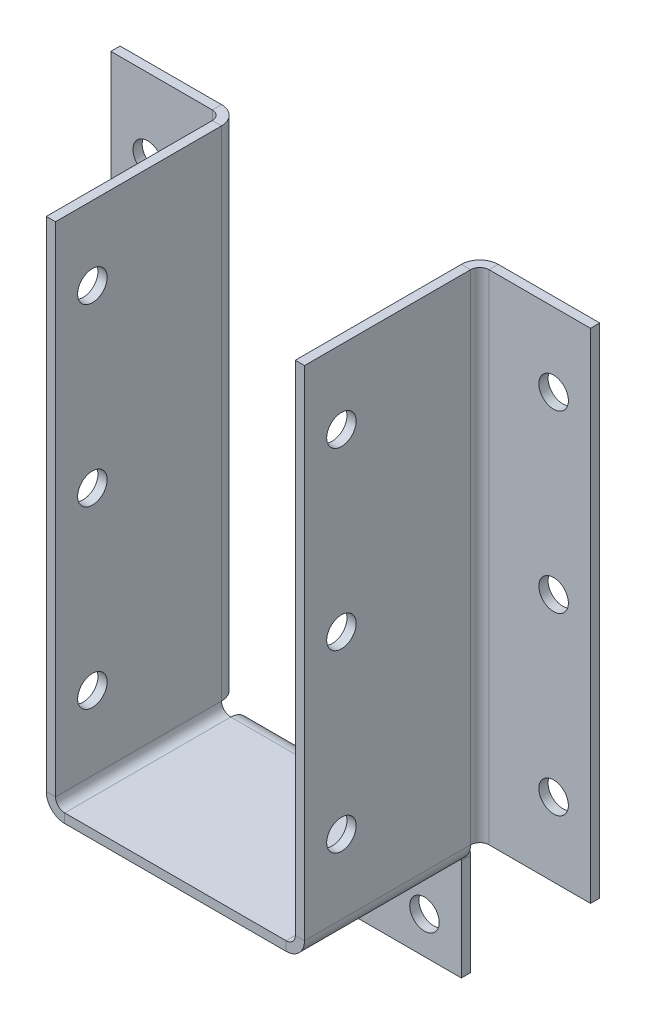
ISO-10303-21;
HEADER;
FILE_DESCRIPTION(('STEP AP214'),'2;1');
FILE_NAME('part.step','',(''),(''),'','','');
FILE_SCHEMA(('AUTOMOTIVE_DESIGN { 1 0 10303 214 1 1 1 1 }'));
ENDSEC;
DATA;
#1=APPLICATION_CONTEXT('core data for automotive mechanical design processes');
#2=APPLICATION_PROTOCOL_DEFINITION('international standard','automotive_design',2000,#1);
#3=PRODUCT_CONTEXT('',#1,'mechanical');
#4=PRODUCT('Part','Part','',(#3));
#5=PRODUCT_RELATED_PRODUCT_CATEGORY('part','',(#4));
#6=PRODUCT_DEFINITION_FORMATION('','',#4);
#7=PRODUCT_DEFINITION_CONTEXT('part definition',#1,'design');
#8=PRODUCT_DEFINITION('design','',#6,#7);
#9=PRODUCT_DEFINITION_SHAPE('','',#8);
#10=(LENGTH_UNIT() NAMED_UNIT(*) SI_UNIT(.MILLI.,.METRE.));
#11=(NAMED_UNIT(*) PLANE_ANGLE_UNIT() SI_UNIT($,.RADIAN.));
#12=(NAMED_UNIT(*) SI_UNIT($,.STERADIAN.) SOLID_ANGLE_UNIT());
#13=UNCERTAINTY_MEASURE_WITH_UNIT(LENGTH_MEASURE(1.E-05),#10,'distance_accuracy_value','');
#14=(GEOMETRIC_REPRESENTATION_CONTEXT(3) GLOBAL_UNCERTAINTY_ASSIGNED_CONTEXT((#13)) GLOBAL_UNIT_ASSIGNED_CONTEXT((#10,
#11,#12)) REPRESENTATION_CONTEXT('',''));
#15=CARTESIAN_POINT('',(0.,0.,0.));
#16=DIRECTION('',(0.,0.,1.));
#17=DIRECTION('',(1.,0.,0.));
#18=AXIS2_PLACEMENT_3D('',#15,#16,#17);
#19=CARTESIAN_POINT('',(19.05,1.5875,3.175));
#20=DIRECTION('',(0.,0.,-1.));
#21=DIRECTION('',(-1.,0.,0.));
#22=AXIS2_PLACEMENT_3D('',#19,#20,#21);
#23=PLANE('',#22);
#24=DIRECTION('',(0.,-1.,0.));
#25=VECTOR('',#24,1.);
#26=CARTESIAN_POINT('',(19.0500000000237,1.5875,3.175));
#27=LINE('',#26,#25);
#28=CARTESIAN_POINT('',(19.05,1.5875,3.175));
#29=VERTEX_POINT('',#28);
#30=CARTESIAN_POINT('',(19.05,0.,3.175));
#31=VERTEX_POINT('',#30);
#32=EDGE_CURVE('E47',#29,#31,#27,.T.);
#33=ORIENTED_EDGE('',*,*,#32,.F.);
#34=CARTESIAN_POINT('',(19.05,3.175,3.175));
#35=DIRECTION('',(0.,0.,1.));
#36=DIRECTION('',(1.,0.,0.));
#37=AXIS2_PLACEMENT_3D('',#34,#35,#36);
#38=CIRCLE('',#37,1.5875);
#39=CARTESIAN_POINT('',(20.6375,3.175,3.175));
#40=VERTEX_POINT('',#39);
#41=EDGE_CURVE('E456',#40,#29,#38,.F.);
#42=ORIENTED_EDGE('',*,*,#41,.F.);
#43=DIRECTION('',(1.,0.,0.));
#44=VECTOR('',#43,1.);
#45=CARTESIAN_POINT('',(20.6375,3.175,3.175));
#46=LINE('',#45,#44);
#47=CARTESIAN_POINT('',(22.225,3.175,3.175));
#48=VERTEX_POINT('',#47);
#49=EDGE_CURVE('E416',#40,#48,#46,.T.);
#50=ORIENTED_EDGE('',*,*,#49,.T.);
#51=CARTESIAN_POINT('',(19.05,3.175,3.175));
#52=DIRECTION('',(0.,0.,1.));
#53=DIRECTION('',(1.,0.,0.));
#54=AXIS2_PLACEMENT_3D('',#51,#52,#53);
#55=CIRCLE('',#54,3.175);
#56=EDGE_CURVE('E452',#48,#31,#55,.F.);
#57=ORIENTED_EDGE('',*,*,#56,.T.);
#58=EDGE_LOOP('',(#33,#42,#50,#57));
#59=FACE_BOUND('',#58,.T.);
#60=ADVANCED_FACE('F32',(#59),#23,.T.);
#61=CARTESIAN_POINT('',(0.,1.5875,31.75));
#62=DIRECTION('',(0.,-1.,0.));
#63=DIRECTION('',(0.,0.,-1.));
#64=AXIS2_PLACEMENT_3D('',#61,#62,#63);
#65=PLANE('',#64);
#66=DIRECTION('',(-1.,0.,0.));
#67=VECTOR('',#66,1.);
#68=CARTESIAN_POINT('',(19.0500000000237,1.5875,3.175));
#69=LINE('',#68,#67);
#70=CARTESIAN_POINT('',(-19.05,1.5875,3.175));
#71=VERTEX_POINT('',#70);
#72=EDGE_CURVE('E378',#29,#71,#69,.T.);
#73=ORIENTED_EDGE('',*,*,#72,.T.);
#74=DIRECTION('',(0.,0.,-1.));
#75=VECTOR('',#74,1.);
#76=CARTESIAN_POINT('',(-19.05,1.5875,31.75));
#77=LINE('',#76,#75);
#78=CARTESIAN_POINT('',(-19.05,1.5875,31.75));
#79=VERTEX_POINT('',#78);
#80=EDGE_CURVE('E313',#79,#71,#77,.T.);
#81=ORIENTED_EDGE('',*,*,#80,.F.);
#82=DIRECTION('',(1.,0.,0.));
#83=VECTOR('',#82,1.);
#84=CARTESIAN_POINT('',(0.,1.5875,31.75));
#85=LINE('',#84,#83);
#86=CARTESIAN_POINT('',(19.05,1.5875,31.75));
#87=VERTEX_POINT('',#86);
#88=EDGE_CURVE('E458',#87,#79,#85,.F.);
#89=ORIENTED_EDGE('',*,*,#88,.F.);
#90=DIRECTION('',(0.,0.,-1.));
#91=VECTOR('',#90,1.);
#92=CARTESIAN_POINT('',(19.05,1.5875,31.75));
#93=LINE('',#92,#91);
#94=EDGE_CURVE('E476',#87,#29,#93,.T.);
#95=ORIENTED_EDGE('',*,*,#94,.T.);
#96=EDGE_LOOP('',(#73,#81,#89,#95));
#97=FACE_BOUND('',#96,.T.);
#98=ADVANCED_FACE('F521',(#97),#65,.F.);
#99=CARTESIAN_POINT('',(0.,0.,31.75));
#100=DIRECTION('',(0.,-1.,0.));
#101=DIRECTION('',(0.,0.,-1.));
#102=AXIS2_PLACEMENT_3D('',#99,#100,#101);
#103=PLANE('',#102);
#104=DIRECTION('',(-1.,0.,0.));
#105=VECTOR('',#104,1.);
#106=CARTESIAN_POINT('',(0.,0.,31.75));
#107=LINE('',#106,#105);
#108=CARTESIAN_POINT('',(19.05,0.,31.75));
#109=VERTEX_POINT('',#108);
#110=CARTESIAN_POINT('',(-19.05,0.,31.75));
#111=VERTEX_POINT('',#110);
#112=EDGE_CURVE('E460',#109,#111,#107,.T.);
#113=ORIENTED_EDGE('',*,*,#112,.T.);
#114=DIRECTION('',(0.,0.,-1.));
#115=VECTOR('',#114,1.);
#116=CARTESIAN_POINT('',(-19.05,0.,31.75));
#117=LINE('',#116,#115);
#118=CARTESIAN_POINT('',(-19.05,0.,3.175));
#119=VERTEX_POINT('',#118);
#120=EDGE_CURVE('E327',#111,#119,#117,.T.);
#121=ORIENTED_EDGE('',*,*,#120,.T.);
#122=DIRECTION('',(-1.,0.,0.));
#123=VECTOR('',#122,1.);
#124=CARTESIAN_POINT('',(19.0500000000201,0.,3.175));
#125=LINE('',#124,#123);
#126=EDGE_CURVE('E381',#31,#119,#125,.T.);
#127=ORIENTED_EDGE('',*,*,#126,.F.);
#128=DIRECTION('',(0.,0.,-1.));
#129=VECTOR('',#128,1.);
#130=CARTESIAN_POINT('',(19.05,0.,31.75));
#131=LINE('',#130,#129);
#132=EDGE_CURVE('E491',#109,#31,#131,.T.);
#133=ORIENTED_EDGE('',*,*,#132,.F.);
#134=EDGE_LOOP('',(#113,#121,#127,#133));
#135=FACE_BOUND('',#134,.T.);
#136=ADVANCED_FACE('F552',(#135),#103,.T.);
#137=CARTESIAN_POINT('',(19.05,3.175,31.75));
#138=DIRECTION('',(0.,0.,-1.));
#139=DIRECTION('',(-1.,0.,0.));
#140=AXIS2_PLACEMENT_3D('',#137,#138,#139);
#141=CYLINDRICAL_SURFACE('',#140,3.175);
#142=ORIENTED_EDGE('',*,*,#132,.T.);
#143=ORIENTED_EDGE('',*,*,#56,.F.);
#144=DIRECTION('',(0.,0.,-1.));
#145=VECTOR('',#144,1.);
#146=CARTESIAN_POINT('',(22.225,3.175,31.75));
#147=LINE('',#146,#145);
#148=CARTESIAN_POINT('',(22.225,3.175,31.75));
#149=VERTEX_POINT('',#148);
#150=EDGE_CURVE('E488',#149,#48,#147,.T.);
#151=ORIENTED_EDGE('',*,*,#150,.F.);
#152=CARTESIAN_POINT('',(19.05,3.175,31.75));
#153=DIRECTION('',(0.,0.,1.));
#154=DIRECTION('',(1.,0.,0.));
#155=AXIS2_PLACEMENT_3D('',#152,#153,#154);
#156=CIRCLE('',#155,3.175);
#157=EDGE_CURVE('E462',#149,#109,#156,.F.);
#158=ORIENTED_EDGE('',*,*,#157,.T.);
#159=EDGE_LOOP('',(#142,#143,#151,#158));
#160=FACE_BOUND('',#159,.T.);
#161=ADVANCED_FACE('F504',(#160),#141,.T.);
#162=CARTESIAN_POINT('',(22.225,88.9,31.75));
#163=DIRECTION('',(1.,0.,0.));
#164=DIRECTION('',(0.,1.,0.));
#165=AXIS2_PLACEMENT_3D('',#162,#163,#164);
#166=PLANE('',#165);
#167=CARTESIAN_POINT('',(22.2250000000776,15.875,25.4));
#168=DIRECTION('',(1.,0.,0.));
#169=DIRECTION('',(0.,1.,0.));
#170=AXIS2_PLACEMENT_3D('',#167,#168,#169);
#171=CIRCLE('',#170,2.54);
#172=CARTESIAN_POINT('',(22.2250000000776,18.415,25.4));
#173=VERTEX_POINT('',#172);
#174=EDGE_CURVE('E335',#173,#173,#171,.T.);
#175=ORIENTED_EDGE('',*,*,#174,.F.);
#176=EDGE_LOOP('',(#175));
#177=FACE_BOUND('',#176,.T.);
#178=CARTESIAN_POINT('',(22.2250000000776,46.0375,25.4));
#179=DIRECTION('',(1.,0.,0.));
#180=DIRECTION('',(0.,1.,0.));
#181=AXIS2_PLACEMENT_3D('',#178,#179,#180);
#182=CIRCLE('',#181,2.54);
#183=CARTESIAN_POINT('',(22.2250000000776,48.5775,25.4));
#184=VERTEX_POINT('',#183);
#185=EDGE_CURVE('E341',#184,#184,#182,.T.);
#186=ORIENTED_EDGE('',*,*,#185,.F.);
#187=EDGE_LOOP('',(#186));
#188=FACE_BOUND('',#187,.T.);
#189=CARTESIAN_POINT('',(22.2250000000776,76.2,25.4));
#190=DIRECTION('',(1.,0.,0.));
#191=DIRECTION('',(0.,1.,0.));
#192=AXIS2_PLACEMENT_3D('',#189,#190,#191);
#193=CIRCLE('',#192,2.54);
#194=CARTESIAN_POINT('',(22.2250000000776,78.74,25.4));
#195=VERTEX_POINT('',#194);
#196=EDGE_CURVE('E347',#195,#195,#193,.T.);
#197=ORIENTED_EDGE('',*,*,#196,.F.);
#198=EDGE_LOOP('',(#197));
#199=FACE_BOUND('',#198,.T.);
#200=ORIENTED_EDGE('',*,*,#150,.T.);
#201=DIRECTION('',(0.,-1.,0.));
#202=VECTOR('',#201,1.);
#203=CARTESIAN_POINT('',(22.2249999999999,517.52500000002,3.175));
#204=LINE('',#203,#202);
#205=CARTESIAN_POINT('',(22.225,88.9000000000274,3.175));
#206=VERTEX_POINT('',#205);
#207=EDGE_CURVE('E408',#206,#48,#204,.T.);
#208=ORIENTED_EDGE('',*,*,#207,.F.);
#209=DIRECTION('',(0.,0.,-1.));
#210=VECTOR('',#209,1.);
#211=CARTESIAN_POINT('',(22.225,88.9,31.75));
#212=LINE('',#211,#210);
#213=CARTESIAN_POINT('',(22.225,88.9,31.75));
#214=VERTEX_POINT('',#213);
#215=EDGE_CURVE('E485',#214,#206,#212,.T.);
#216=ORIENTED_EDGE('',*,*,#215,.F.);
#217=DIRECTION('',(0.,-1.,0.));
#218=VECTOR('',#217,1.);
#219=CARTESIAN_POINT('',(22.225,88.9,31.75));
#220=LINE('',#219,#218);
#221=EDGE_CURVE('E465',#214,#149,#220,.T.);
#222=ORIENTED_EDGE('',*,*,#221,.T.);
#223=EDGE_LOOP('',(#200,#208,#216,#222));
#224=FACE_BOUND('',#223,.T.);
#225=ADVANCED_FACE('F508',(#177,#188,#199,#224),#166,.T.);
#226=CARTESIAN_POINT('',(20.6375,88.9,31.75));
#227=DIRECTION('',(0.,1.,0.));
#228=DIRECTION('',(0.,0.,1.));
#229=AXIS2_PLACEMENT_3D('',#226,#227,#228);
#230=PLANE('',#229);
#231=ORIENTED_EDGE('',*,*,#215,.T.);
#232=DIRECTION('',(1.,0.,0.));
#233=VECTOR('',#232,1.);
#234=CARTESIAN_POINT('',(20.6375,88.9000000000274,3.175));
#235=LINE('',#234,#233);
#236=CARTESIAN_POINT('',(20.6375,88.9000000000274,3.175));
#237=VERTEX_POINT('',#236);
#238=EDGE_CURVE('E419',#237,#206,#235,.T.);
#239=ORIENTED_EDGE('',*,*,#238,.F.);
#240=DIRECTION('',(0.,0.,-1.));
#241=VECTOR('',#240,1.);
#242=CARTESIAN_POINT('',(20.6375,88.9,31.75));
#243=LINE('',#242,#241);
#244=CARTESIAN_POINT('',(20.6375,88.9,31.75));
#245=VERTEX_POINT('',#244);
#246=EDGE_CURVE('E482',#245,#237,#243,.T.);
#247=ORIENTED_EDGE('',*,*,#246,.F.);
#248=DIRECTION('',(1.,0.,0.));
#249=VECTOR('',#248,1.);
#250=CARTESIAN_POINT('',(20.6375,88.9,31.75));
#251=LINE('',#250,#249);
#252=EDGE_CURVE('E468',#245,#214,#251,.T.);
#253=ORIENTED_EDGE('',*,*,#252,.T.);
#254=EDGE_LOOP('',(#231,#239,#247,#253));
#255=FACE_BOUND('',#254,.T.);
#256=ADVANCED_FACE('F511',(#255),#230,.T.);
#257=CARTESIAN_POINT('',(20.6375,88.9,31.75));
#258=DIRECTION('',(1.,0.,0.));
#259=DIRECTION('',(0.,1.,0.));
#260=AXIS2_PLACEMENT_3D('',#257,#258,#259);
#261=PLANE('',#260);
#262=CARTESIAN_POINT('',(20.6375,15.875,25.4));
#263=DIRECTION('',(1.,0.,0.));
#264=DIRECTION('',(0.,1.,0.));
#265=AXIS2_PLACEMENT_3D('',#262,#263,#264);
#266=CIRCLE('',#265,2.54);
#267=CARTESIAN_POINT('',(20.6375,18.415,25.4));
#268=VERTEX_POINT('',#267);
#269=EDGE_CURVE('E338',#268,#268,#266,.F.);
#270=ORIENTED_EDGE('',*,*,#269,.F.);
#271=EDGE_LOOP('',(#270));
#272=FACE_BOUND('',#271,.T.);
#273=CARTESIAN_POINT('',(20.6375,46.0375,25.4));
#274=DIRECTION('',(1.,0.,0.));
#275=DIRECTION('',(0.,1.,0.));
#276=AXIS2_PLACEMENT_3D('',#273,#274,#275);
#277=CIRCLE('',#276,2.54);
#278=CARTESIAN_POINT('',(20.6375,48.5775,25.4));
#279=VERTEX_POINT('',#278);
#280=EDGE_CURVE('E344',#279,#279,#277,.F.);
#281=ORIENTED_EDGE('',*,*,#280,.F.);
#282=EDGE_LOOP('',(#281));
#283=FACE_BOUND('',#282,.T.);
#284=CARTESIAN_POINT('',(20.6375,76.2,25.4));
#285=DIRECTION('',(1.,0.,0.));
#286=DIRECTION('',(0.,1.,0.));
#287=AXIS2_PLACEMENT_3D('',#284,#285,#286);
#288=CIRCLE('',#287,2.54);
#289=CARTESIAN_POINT('',(20.6375,78.74,25.4));
#290=VERTEX_POINT('',#289);
#291=EDGE_CURVE('E350',#290,#290,#288,.F.);
#292=ORIENTED_EDGE('',*,*,#291,.F.);
#293=EDGE_LOOP('',(#292));
#294=FACE_BOUND('',#293,.T.);
#295=DIRECTION('',(0.,-1.,0.));
#296=VECTOR('',#295,1.);
#297=CARTESIAN_POINT('',(20.6374999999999,517.525000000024,3.175));
#298=LINE('',#297,#296);
#299=EDGE_CURVE('E399',#237,#40,#298,.T.);
#300=ORIENTED_EDGE('',*,*,#299,.T.);
#301=DIRECTION('',(0.,0.,-1.));
#302=VECTOR('',#301,1.);
#303=CARTESIAN_POINT('',(20.6375,3.175,31.75));
#304=LINE('',#303,#302);
#305=CARTESIAN_POINT('',(20.6375,3.175,31.75));
#306=VERTEX_POINT('',#305);
#307=EDGE_CURVE('E479',#306,#40,#304,.T.);
#308=ORIENTED_EDGE('',*,*,#307,.F.);
#309=DIRECTION('',(0.,-1.,0.));
#310=VECTOR('',#309,1.);
#311=CARTESIAN_POINT('',(20.6375,88.9,31.75));
#312=LINE('',#311,#310);
#313=EDGE_CURVE('E471',#245,#306,#312,.T.);
#314=ORIENTED_EDGE('',*,*,#313,.F.);
#315=ORIENTED_EDGE('',*,*,#246,.T.);
#316=EDGE_LOOP('',(#300,#308,#314,#315));
#317=FACE_BOUND('',#316,.T.);
#318=ADVANCED_FACE('F513',(#272,#283,#294,#317),#261,.F.);
#319=CARTESIAN_POINT('',(19.05,3.175,31.75));
#320=DIRECTION('',(0.,0.,-1.));
#321=DIRECTION('',(-1.,0.,0.));
#322=AXIS2_PLACEMENT_3D('',#319,#320,#321);
#323=CYLINDRICAL_SURFACE('',#322,1.5875);
#324=ORIENTED_EDGE('',*,*,#41,.T.);
#325=ORIENTED_EDGE('',*,*,#94,.F.);
#326=CARTESIAN_POINT('',(19.05,3.175,31.75));
#327=DIRECTION('',(0.,0.,1.));
#328=DIRECTION('',(1.,0.,0.));
#329=AXIS2_PLACEMENT_3D('',#326,#327,#328);
#330=CIRCLE('',#329,1.5875);
#331=EDGE_CURVE('E474',#306,#87,#330,.F.);
#332=ORIENTED_EDGE('',*,*,#331,.F.);
#333=ORIENTED_EDGE('',*,*,#307,.T.);
#334=EDGE_LOOP('',(#324,#325,#332,#333));
#335=FACE_BOUND('',#334,.T.);
#336=ADVANCED_FACE('F517',(#335),#323,.F.);
#337=CARTESIAN_POINT('',(19.05,0.,31.75));
#338=DIRECTION('',(0.,0.,1.));
#339=DIRECTION('',(1.,0.,0.));
#340=AXIS2_PLACEMENT_3D('',#337,#338,#339);
#341=PLANE('',#340);
#342=DIRECTION('',(0.,1.,0.));
#343=VECTOR('',#342,1.);
#344=CARTESIAN_POINT('',(19.05,0.,31.75));
#345=LINE('',#344,#343);
#346=EDGE_CURVE('E11',#109,#87,#345,.T.);
#347=ORIENTED_EDGE('',*,*,#346,.F.);
#348=ORIENTED_EDGE('',*,*,#157,.F.);
#349=DIRECTION('',(1.,0.,0.));
#350=VECTOR('',#349,1.);
#351=CARTESIAN_POINT('',(20.6375,3.175,31.75));
#352=LINE('',#351,#350);
#353=EDGE_CURVE('E40',#306,#149,#352,.T.);
#354=ORIENTED_EDGE('',*,*,#353,.F.);
#355=ORIENTED_EDGE('',*,*,#331,.T.);
#356=EDGE_LOOP('',(#347,#348,#354,#355));
#357=FACE_BOUND('',#356,.T.);
#358=ADVANCED_FACE('F34',(#357),#341,.T.);
#359=CARTESIAN_POINT('',(20.6375,3.175,31.75));
#360=DIRECTION('',(0.,0.,1.));
#361=DIRECTION('',(1.,0.,0.));
#362=AXIS2_PLACEMENT_3D('',#359,#360,#361);
#363=PLANE('',#362);
#364=ORIENTED_EDGE('',*,*,#112,.F.);
#365=ORIENTED_EDGE('',*,*,#346,.T.);
#366=ORIENTED_EDGE('',*,*,#88,.T.);
#367=DIRECTION('',(0.,1.,0.));
#368=VECTOR('',#367,1.);
#369=CARTESIAN_POINT('',(-19.05,0.,31.75));
#370=LINE('',#369,#368);
#371=EDGE_CURVE('E332',#111,#79,#370,.T.);
#372=ORIENTED_EDGE('',*,*,#371,.F.);
#373=EDGE_LOOP('',(#364,#365,#366,#372));
#374=FACE_BOUND('',#373,.T.);
#375=ADVANCED_FACE('F523',(#374),#363,.T.);
#376=CARTESIAN_POINT('',(19.05,3.175,31.75));
#377=DIRECTION('',(0.,0.,1.));
#378=DIRECTION('',(1.,0.,0.));
#379=AXIS2_PLACEMENT_3D('',#376,#377,#378);
#380=PLANE('',#379);
#381=ORIENTED_EDGE('',*,*,#313,.T.);
#382=ORIENTED_EDGE('',*,*,#353,.T.);
#383=ORIENTED_EDGE('',*,*,#221,.F.);
#384=ORIENTED_EDGE('',*,*,#252,.F.);
#385=EDGE_LOOP('',(#381,#382,#383,#384));
#386=FACE_BOUND('',#385,.T.);
#387=ADVANCED_FACE('F496',(#386),#380,.T.);
#388=CARTESIAN_POINT('',(41.275,88.9,0.));
#389=DIRECTION('',(-1.,0.,0.));
#390=DIRECTION('',(0.,-1.,0.));
#391=AXIS2_PLACEMENT_3D('',#388,#389,#390);
#392=PLANE('',#391);
#393=DIRECTION('',(0.,0.,1.));
#394=VECTOR('',#393,1.);
#395=CARTESIAN_POINT('',(41.275,3.175,0.));
#396=LINE('',#395,#394);
#397=CARTESIAN_POINT('',(41.275,3.175,0.));
#398=VERTEX_POINT('',#397);
#399=CARTESIAN_POINT('',(41.275,3.175,1.5875));
#400=VERTEX_POINT('',#399);
#401=EDGE_CURVE('E450',#398,#400,#396,.T.);
#402=ORIENTED_EDGE('',*,*,#401,.F.);
#403=DIRECTION('',(0.,-1.,0.));
#404=VECTOR('',#403,1.);
#405=CARTESIAN_POINT('',(41.275,88.9,0.));
#406=LINE('',#405,#404);
#407=CARTESIAN_POINT('',(41.275,88.9,0.));
#408=VERTEX_POINT('',#407);
#409=EDGE_CURVE('E421',#408,#398,#406,.T.);
#410=ORIENTED_EDGE('',*,*,#409,.F.);
#411=DIRECTION('',(0.,0.,1.));
#412=VECTOR('',#411,1.);
#413=CARTESIAN_POINT('',(41.275,88.9,0.));
#414=LINE('',#413,#412);
#415=CARTESIAN_POINT('',(41.275,88.9,1.5875));
#416=VERTEX_POINT('',#415);
#417=EDGE_CURVE('E448',#408,#416,#414,.T.);
#418=ORIENTED_EDGE('',*,*,#417,.T.);
#419=DIRECTION('',(0.,1.,0.));
#420=VECTOR('',#419,1.);
#421=CARTESIAN_POINT('',(41.275,88.9,1.5875));
#422=LINE('',#421,#420);
#423=EDGE_CURVE('E432',#416,#400,#422,.F.);
#424=ORIENTED_EDGE('',*,*,#423,.T.);
#425=EDGE_LOOP('',(#402,#410,#418,#424));
#426=FACE_BOUND('',#425,.T.);
#427=ADVANCED_FACE('F595',(#426),#392,.F.);
#428=CARTESIAN_POINT('',(41.275,88.9,0.));
#429=DIRECTION('',(1.15057031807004E-12,1.,0.));
#430=DIRECTION('',(-1.,1.15057031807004E-12,0.));
#431=AXIS2_PLACEMENT_3D('',#428,#429,#430);
#432=PLANE('',#431);
#433=ORIENTED_EDGE('',*,*,#417,.F.);
#434=DIRECTION('',(-1.,1.15057031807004E-12,0.));
#435=VECTOR('',#434,1.);
#436=CARTESIAN_POINT('',(41.275,88.9,0.));
#437=LINE('',#436,#435);
#438=CARTESIAN_POINT('',(23.8125,88.9000000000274,0.));
#439=VERTEX_POINT('',#438);
#440=EDGE_CURVE('E422',#408,#439,#437,.T.);
#441=ORIENTED_EDGE('',*,*,#440,.T.);
#442=DIRECTION('',(0.,0.,1.));
#443=VECTOR('',#442,1.);
#444=CARTESIAN_POINT('',(23.8125,88.9000000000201,0.));
#445=LINE('',#444,#443);
#446=CARTESIAN_POINT('',(23.8125,88.9000000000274,1.5875));
#447=VERTEX_POINT('',#446);
#448=EDGE_CURVE('E445',#439,#447,#445,.T.);
#449=ORIENTED_EDGE('',*,*,#448,.T.);
#450=DIRECTION('',(1.,0.,0.));
#451=VECTOR('',#450,1.);
#452=CARTESIAN_POINT('',(41.275,88.9,1.5875));
#453=LINE('',#452,#451);
#454=EDGE_CURVE('E437',#416,#447,#453,.F.);
#455=ORIENTED_EDGE('',*,*,#454,.F.);
#456=EDGE_LOOP('',(#433,#441,#449,#455));
#457=FACE_BOUND('',#456,.T.);
#458=ADVANCED_FACE('F625',(#457),#432,.T.);
#459=CARTESIAN_POINT('',(41.275,3.175,0.));
#460=DIRECTION('',(0.,-1.,0.));
#461=DIRECTION('',(1.,0.,0.));
#462=AXIS2_PLACEMENT_3D('',#459,#460,#461);
#463=PLANE('',#462);
#464=DIRECTION('',(1.,0.,0.));
#465=VECTOR('',#464,1.);
#466=CARTESIAN_POINT('',(41.275,3.175,0.));
#467=LINE('',#466,#465);
#468=CARTESIAN_POINT('',(23.8125,3.175,0.));
#469=VERTEX_POINT('',#468);
#470=EDGE_CURVE('E429',#469,#398,#467,.T.);
#471=ORIENTED_EDGE('',*,*,#470,.T.);
#472=ORIENTED_EDGE('',*,*,#401,.T.);
#473=DIRECTION('',(1.,0.,0.));
#474=VECTOR('',#473,1.);
#475=CARTESIAN_POINT('',(41.275,3.175,1.5875));
#476=LINE('',#475,#474);
#477=CARTESIAN_POINT('',(23.8125,3.175,1.5875));
#478=VERTEX_POINT('',#477);
#479=EDGE_CURVE('E436',#478,#400,#476,.T.);
#480=ORIENTED_EDGE('',*,*,#479,.F.);
#481=DIRECTION('',(0.,0.,1.));
#482=VECTOR('',#481,1.);
#483=CARTESIAN_POINT('',(23.8125,3.175,0.));
#484=LINE('',#483,#482);
#485=EDGE_CURVE('E444',#469,#478,#484,.T.);
#486=ORIENTED_EDGE('',*,*,#485,.F.);
#487=EDGE_LOOP('',(#471,#472,#480,#486));
#488=FACE_BOUND('',#487,.T.);
#489=ADVANCED_FACE('F591',(#488),#463,.T.);
#490=CARTESIAN_POINT('',(41.275,88.9,1.5875));
#491=DIRECTION('',(0.,0.,1.));
#492=DIRECTION('',(1.,0.,0.));
#493=AXIS2_PLACEMENT_3D('',#490,#491,#492);
#494=PLANE('',#493);
#495=CARTESIAN_POINT('',(34.925,15.875,1.5875));
#496=DIRECTION('',(0.,0.,1.));
#497=DIRECTION('',(1.,0.,0.));
#498=AXIS2_PLACEMENT_3D('',#495,#496,#497);
#499=CIRCLE('',#498,2.54);
#500=CARTESIAN_POINT('',(37.465,15.875,1.5875));
#501=VERTEX_POINT('',#500);
#502=EDGE_CURVE('E357',#501,#501,#499,.F.);
#503=ORIENTED_EDGE('',*,*,#502,.T.);
#504=EDGE_LOOP('',(#503));
#505=FACE_BOUND('',#504,.T.);
#506=CARTESIAN_POINT('',(34.925,46.0375,1.5875));
#507=DIRECTION('',(0.,0.,1.));
#508=DIRECTION('',(1.,0.,0.));
#509=AXIS2_PLACEMENT_3D('',#506,#507,#508);
#510=CIRCLE('',#509,2.54);
#511=CARTESIAN_POINT('',(37.465,46.0375,1.5875));
#512=VERTEX_POINT('',#511);
#513=EDGE_CURVE('E363',#512,#512,#510,.F.);
#514=ORIENTED_EDGE('',*,*,#513,.T.);
#515=EDGE_LOOP('',(#514));
#516=FACE_BOUND('',#515,.T.);
#517=CARTESIAN_POINT('',(34.925,76.2,1.5875));
#518=DIRECTION('',(0.,0.,1.));
#519=DIRECTION('',(1.,0.,0.));
#520=AXIS2_PLACEMENT_3D('',#517,#518,#519);
#521=CIRCLE('',#520,2.54);
#522=CARTESIAN_POINT('',(37.465,76.2,1.5875));
#523=VERTEX_POINT('',#522);
#524=EDGE_CURVE('E369',#523,#523,#521,.F.);
#525=ORIENTED_EDGE('',*,*,#524,.T.);
#526=EDGE_LOOP('',(#525));
#527=FACE_BOUND('',#526,.T.);
#528=DIRECTION('',(0.,1.,0.));
#529=VECTOR('',#528,1.);
#530=CARTESIAN_POINT('',(23.8125,88.9,1.5875));
#531=LINE('',#530,#529);
#532=EDGE_CURVE('E433',#447,#478,#531,.F.);
#533=ORIENTED_EDGE('',*,*,#532,.T.);
#534=ORIENTED_EDGE('',*,*,#479,.T.);
#535=ORIENTED_EDGE('',*,*,#423,.F.);
#536=ORIENTED_EDGE('',*,*,#454,.T.);
#537=EDGE_LOOP('',(#533,#534,#535,#536));
#538=FACE_BOUND('',#537,.T.);
#539=ADVANCED_FACE('F635',(#505,#516,#527,#538),#494,.T.);
#540=CARTESIAN_POINT('',(41.275,88.9,0.));
#541=DIRECTION('',(0.,0.,1.));
#542=DIRECTION('',(1.,0.,0.));
#543=AXIS2_PLACEMENT_3D('',#540,#541,#542);
#544=PLANE('',#543);
#545=CARTESIAN_POINT('',(34.925,15.875,0.));
#546=DIRECTION('',(0.,0.,-1.));
#547=DIRECTION('',(-1.,0.,0.));
#548=AXIS2_PLACEMENT_3D('',#545,#546,#547);
#549=CIRCLE('',#548,2.54);
#550=CARTESIAN_POINT('',(32.385,15.875,0.));
#551=VERTEX_POINT('',#550);
#552=EDGE_CURVE('E360',#551,#551,#549,.T.);
#553=ORIENTED_EDGE('',*,*,#552,.F.);
#554=EDGE_LOOP('',(#553));
#555=FACE_BOUND('',#554,.T.);
#556=CARTESIAN_POINT('',(34.925,46.0375,0.));
#557=DIRECTION('',(0.,0.,-1.));
#558=DIRECTION('',(-1.,0.,0.));
#559=AXIS2_PLACEMENT_3D('',#556,#557,#558);
#560=CIRCLE('',#559,2.54);
#561=CARTESIAN_POINT('',(32.385,46.0375,0.));
#562=VERTEX_POINT('',#561);
#563=EDGE_CURVE('E366',#562,#562,#560,.T.);
#564=ORIENTED_EDGE('',*,*,#563,.F.);
#565=EDGE_LOOP('',(#564));
#566=FACE_BOUND('',#565,.T.);
#567=CARTESIAN_POINT('',(34.925,76.2,0.));
#568=DIRECTION('',(0.,0.,-1.));
#569=DIRECTION('',(-1.,0.,0.));
#570=AXIS2_PLACEMENT_3D('',#567,#568,#569);
#571=CIRCLE('',#570,2.54);
#572=CARTESIAN_POINT('',(32.385,76.2,0.));
#573=VERTEX_POINT('',#572);
#574=EDGE_CURVE('E372',#573,#573,#571,.T.);
#575=ORIENTED_EDGE('',*,*,#574,.F.);
#576=EDGE_LOOP('',(#575));
#577=FACE_BOUND('',#576,.T.);
#578=DIRECTION('',(0.,-1.,0.));
#579=VECTOR('',#578,1.);
#580=CARTESIAN_POINT('',(23.8125,88.9000000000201,0.));
#581=LINE('',#580,#579);
#582=EDGE_CURVE('E425',#439,#469,#581,.T.);
#583=ORIENTED_EDGE('',*,*,#582,.F.);
#584=ORIENTED_EDGE('',*,*,#440,.F.);
#585=ORIENTED_EDGE('',*,*,#409,.T.);
#586=ORIENTED_EDGE('',*,*,#470,.F.);
#587=EDGE_LOOP('',(#583,#584,#585,#586));
#588=FACE_BOUND('',#587,.T.);
#589=ADVANCED_FACE('F643',(#555,#566,#577,#588),#544,.F.);
#590=CARTESIAN_POINT('',(23.8125,3.175,3.175));
#591=DIRECTION('',(0.,1.,0.));
#592=DIRECTION('',(-1.,0.,0.));
#593=AXIS2_PLACEMENT_3D('',#590,#591,#592);
#594=PLANE('',#593);
#595=ORIENTED_EDGE('',*,*,#49,.F.);
#596=CARTESIAN_POINT('',(23.8125,3.175,3.175));
#597=DIRECTION('',(0.,-1.,0.));
#598=DIRECTION('',(1.,0.,0.));
#599=AXIS2_PLACEMENT_3D('',#596,#597,#598);
#600=CIRCLE('',#599,3.175);
#601=EDGE_CURVE('E402',#40,#469,#600,.T.);
#602=ORIENTED_EDGE('',*,*,#601,.T.);
#603=ORIENTED_EDGE('',*,*,#485,.T.);
#604=CARTESIAN_POINT('',(23.8125,3.17500000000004,3.175));
#605=DIRECTION('',(0.,-1.,0.));
#606=DIRECTION('',(1.,0.,0.));
#607=AXIS2_PLACEMENT_3D('',#604,#605,#606);
#608=CIRCLE('',#607,1.5875);
#609=EDGE_CURVE('E409',#48,#478,#608,.T.);
#610=ORIENTED_EDGE('',*,*,#609,.F.);
#611=EDGE_LOOP('',(#595,#602,#603,#610));
#612=FACE_BOUND('',#611,.T.);
#613=ADVANCED_FACE('F658',(#612),#594,.F.);
#614=CARTESIAN_POINT('',(23.8125,88.9000000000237,3.175));
#615=DIRECTION('',(0.,-1.,1.14963594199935E-12));
#616=DIRECTION('',(0.,-1.14963594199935E-12,-1.));
#617=AXIS2_PLACEMENT_3D('',#614,#615,#616);
#618=PLANE('',#617);
#619=CARTESIAN_POINT('',(23.8125,88.9000000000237,3.175));
#620=DIRECTION('',(0.,1.,-1.14963594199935E-12));
#621=DIRECTION('',(0.,1.14963594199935E-12,1.));
#622=AXIS2_PLACEMENT_3D('',#619,#620,#621);
#623=CIRCLE('',#622,3.175);
#624=EDGE_CURVE('E405',#439,#237,#623,.T.);
#625=ORIENTED_EDGE('',*,*,#624,.T.);
#626=ORIENTED_EDGE('',*,*,#238,.T.);
#627=CARTESIAN_POINT('',(23.8125,88.9000000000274,3.175));
#628=DIRECTION('',(0.,-1.,0.));
#629=DIRECTION('',(1.,0.,0.));
#630=AXIS2_PLACEMENT_3D('',#627,#628,#629);
#631=CIRCLE('',#630,1.5875);
#632=EDGE_CURVE('E411',#447,#206,#631,.F.);
#633=ORIENTED_EDGE('',*,*,#632,.F.);
#634=ORIENTED_EDGE('',*,*,#448,.F.);
#635=EDGE_LOOP('',(#625,#626,#633,#634));
#636=FACE_BOUND('',#635,.T.);
#637=ADVANCED_FACE('F581',(#636),#618,.F.);
#638=CARTESIAN_POINT('',(23.8124999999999,517.52500000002,3.175));
#639=DIRECTION('',(0.,-1.,0.));
#640=DIRECTION('',(1.,0.,0.));
#641=AXIS2_PLACEMENT_3D('',#638,#639,#640);
#642=CYLINDRICAL_SURFACE('',#641,1.5875);
#643=ORIENTED_EDGE('',*,*,#532,.F.);
#644=ORIENTED_EDGE('',*,*,#632,.T.);
#645=ORIENTED_EDGE('',*,*,#207,.T.);
#646=ORIENTED_EDGE('',*,*,#609,.T.);
#647=EDGE_LOOP('',(#643,#644,#645,#646));
#648=FACE_BOUND('',#647,.T.);
#649=ADVANCED_FACE('F578',(#648),#642,.F.);
#650=CARTESIAN_POINT('',(23.8124999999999,517.52500000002,3.175));
#651=DIRECTION('',(0.,-1.,0.));
#652=DIRECTION('',(1.,0.,0.));
#653=AXIS2_PLACEMENT_3D('',#650,#651,#652);
#654=CYLINDRICAL_SURFACE('',#653,3.175);
#655=ORIENTED_EDGE('',*,*,#582,.T.);
#656=ORIENTED_EDGE('',*,*,#601,.F.);
#657=ORIENTED_EDGE('',*,*,#299,.F.);
#658=ORIENTED_EDGE('',*,*,#624,.F.);
#659=EDGE_LOOP('',(#655,#656,#657,#658));
#660=FACE_BOUND('',#659,.T.);
#661=ADVANCED_FACE('F569',(#660),#654,.T.);
#662=CARTESIAN_POINT('',(19.05,-19.05,0.));
#663=DIRECTION('',(0.,1.,0.));
#664=DIRECTION('',(-1.,0.,0.));
#665=AXIS2_PLACEMENT_3D('',#662,#663,#664);
#666=PLANE('',#665);
#667=DIRECTION('',(1.,0.,0.));
#668=VECTOR('',#667,1.);
#669=CARTESIAN_POINT('',(19.05,-19.05,1.5875));
#670=LINE('',#669,#668);
#671=CARTESIAN_POINT('',(19.05,-19.05,1.5875));
#672=VERTEX_POINT('',#671);
#673=CARTESIAN_POINT('',(-19.05,-19.05,1.5875));
#674=VERTEX_POINT('',#673);
#675=EDGE_CURVE('E205',#672,#674,#670,.F.);
#676=ORIENTED_EDGE('',*,*,#675,.T.);
#677=DIRECTION('',(0.,0.,1.));
#678=VECTOR('',#677,1.);
#679=CARTESIAN_POINT('',(-19.05,-19.05,0.));
#680=LINE('',#679,#678);
#681=CARTESIAN_POINT('',(-19.05,-19.05,0.));
#682=VERTEX_POINT('',#681);
#683=EDGE_CURVE('E234',#682,#674,#680,.T.);
#684=ORIENTED_EDGE('',*,*,#683,.F.);
#685=DIRECTION('',(-1.,0.,0.));
#686=VECTOR('',#685,1.);
#687=CARTESIAN_POINT('',(19.05,-19.05,0.));
#688=LINE('',#687,#686);
#689=CARTESIAN_POINT('',(19.05,-19.05,0.));
#690=VERTEX_POINT('',#689);
#691=EDGE_CURVE('E226',#690,#682,#688,.T.);
#692=ORIENTED_EDGE('',*,*,#691,.F.);
#693=DIRECTION('',(0.,0.,1.));
#694=VECTOR('',#693,1.);
#695=CARTESIAN_POINT('',(19.05,-19.05,0.));
#696=LINE('',#695,#694);
#697=EDGE_CURVE('E397',#690,#672,#696,.T.);
#698=ORIENTED_EDGE('',*,*,#697,.T.);
#699=EDGE_LOOP('',(#676,#684,#692,#698));
#700=FACE_BOUND('',#699,.T.);
#701=ADVANCED_FACE('F567',(#700),#666,.F.);
#702=CARTESIAN_POINT('',(19.05,-19.05,0.));
#703=DIRECTION('',(1.,-1.1500649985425E-12,0.));
#704=DIRECTION('',(1.1500649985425E-12,1.,0.));
#705=AXIS2_PLACEMENT_3D('',#702,#703,#704);
#706=PLANE('',#705);
#707=ORIENTED_EDGE('',*,*,#697,.F.);
#708=DIRECTION('',(1.1500649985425E-12,1.,0.));
#709=VECTOR('',#708,1.);
#710=CARTESIAN_POINT('',(19.05,-19.05,0.));
#711=LINE('',#710,#709);
#712=CARTESIAN_POINT('',(19.0500000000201,-1.5875,0.));
#713=VERTEX_POINT('',#712);
#714=EDGE_CURVE('E206',#690,#713,#711,.T.);
#715=ORIENTED_EDGE('',*,*,#714,.T.);
#716=DIRECTION('',(0.,0.,1.));
#717=VECTOR('',#716,1.);
#718=CARTESIAN_POINT('',(19.0500000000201,-1.5875,0.));
#719=LINE('',#718,#717);
#720=CARTESIAN_POINT('',(19.0500000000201,-1.5875,1.5875));
#721=VERTEX_POINT('',#720);
#722=EDGE_CURVE('E390',#713,#721,#719,.T.);
#723=ORIENTED_EDGE('',*,*,#722,.T.);
#724=DIRECTION('',(0.,-1.,0.));
#725=VECTOR('',#724,1.);
#726=CARTESIAN_POINT('',(19.05,-19.05,1.5875));
#727=LINE('',#726,#725);
#728=EDGE_CURVE('E391',#672,#721,#727,.F.);
#729=ORIENTED_EDGE('',*,*,#728,.F.);
#730=EDGE_LOOP('',(#707,#715,#723,#729));
#731=FACE_BOUND('',#730,.T.);
#732=ADVANCED_FACE('F565',(#731),#706,.T.);
#733=CARTESIAN_POINT('',(19.05,-19.05,1.5875));
#734=DIRECTION('',(0.,0.,1.));
#735=DIRECTION('',(0.,-1.,0.));
#736=AXIS2_PLACEMENT_3D('',#733,#734,#735);
#737=PLANE('',#736);
#738=CARTESIAN_POINT('',(12.7,-12.7,1.5875));
#739=DIRECTION('',(0.,0.,1.));
#740=DIRECTION('',(1.,0.,0.));
#741=AXIS2_PLACEMENT_3D('',#738,#739,#740);
#742=CIRCLE('',#741,2.54);
#743=CARTESIAN_POINT('',(15.24,-12.7,1.5875));
#744=VERTEX_POINT('',#743);
#745=EDGE_CURVE('E353',#744,#744,#742,.F.);
#746=ORIENTED_EDGE('',*,*,#745,.T.);
#747=EDGE_LOOP('',(#746));
#748=FACE_BOUND('',#747,.T.);
#749=DIRECTION('',(1.,0.,0.));
#750=VECTOR('',#749,1.);
#751=CARTESIAN_POINT('',(19.05,-1.5875,1.5875));
#752=LINE('',#751,#750);
#753=CARTESIAN_POINT('',(-19.0500000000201,-1.5875,1.5875));
#754=VERTEX_POINT('',#753);
#755=EDGE_CURVE('E388',#721,#754,#752,.F.);
#756=ORIENTED_EDGE('',*,*,#755,.T.);
#757=DIRECTION('',(0.,-1.,0.));
#758=VECTOR('',#757,1.);
#759=CARTESIAN_POINT('',(-19.05,-19.05,1.5875));
#760=LINE('',#759,#758);
#761=EDGE_CURVE('E230',#674,#754,#760,.F.);
#762=ORIENTED_EDGE('',*,*,#761,.F.);
#763=ORIENTED_EDGE('',*,*,#675,.F.);
#764=ORIENTED_EDGE('',*,*,#728,.T.);
#765=EDGE_LOOP('',(#756,#762,#763,#764));
#766=FACE_BOUND('',#765,.T.);
#767=CARTESIAN_POINT('',(-12.7,-12.7,1.5875));
#768=DIRECTION('',(0.,0.,-1.));
#769=DIRECTION('',(-1.,0.,0.));
#770=AXIS2_PLACEMENT_3D('',#767,#768,#769);
#771=CIRCLE('',#770,2.54);
#772=CARTESIAN_POINT('',(-15.24,-12.7,1.5875));
#773=VERTEX_POINT('',#772);
#774=EDGE_CURVE('E1058',#773,#773,#771,.F.);
#775=ORIENTED_EDGE('',*,*,#774,.F.);
#776=EDGE_LOOP('',(#775));
#777=FACE_BOUND('',#776,.T.);
#778=ADVANCED_FACE('F560',(#748,#766,#777),#737,.T.);
#779=CARTESIAN_POINT('',(19.05,-19.05,0.));
#780=DIRECTION('',(0.,0.,1.));
#781=DIRECTION('',(0.,-1.,0.));
#782=AXIS2_PLACEMENT_3D('',#779,#780,#781);
#783=PLANE('',#782);
#784=CARTESIAN_POINT('',(12.7,-12.7,0.));
#785=DIRECTION('',(0.,0.,-1.));
#786=DIRECTION('',(-1.,0.,0.));
#787=AXIS2_PLACEMENT_3D('',#784,#785,#786);
#788=CIRCLE('',#787,2.54);
#789=CARTESIAN_POINT('',(10.16,-12.7,0.));
#790=VERTEX_POINT('',#789);
#791=EDGE_CURVE('E354',#790,#790,#788,.T.);
#792=ORIENTED_EDGE('',*,*,#791,.F.);
#793=EDGE_LOOP('',(#792));
#794=FACE_BOUND('',#793,.T.);
#795=DIRECTION('',(-1.,0.,0.));
#796=VECTOR('',#795,1.);
#797=CARTESIAN_POINT('',(19.0500000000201,-1.5875,0.));
#798=LINE('',#797,#796);
#799=CARTESIAN_POINT('',(-19.0500000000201,-1.5875,0.));
#800=VERTEX_POINT('',#799);
#801=EDGE_CURVE('E193',#713,#800,#798,.T.);
#802=ORIENTED_EDGE('',*,*,#801,.F.);
#803=ORIENTED_EDGE('',*,*,#714,.F.);
#804=ORIENTED_EDGE('',*,*,#691,.T.);
#805=DIRECTION('',(-1.1500649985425E-12,1.,0.));
#806=VECTOR('',#805,1.);
#807=CARTESIAN_POINT('',(-19.05,-19.05,0.));
#808=LINE('',#807,#806);
#809=EDGE_CURVE('E222',#682,#800,#808,.T.);
#810=ORIENTED_EDGE('',*,*,#809,.T.);
#811=EDGE_LOOP('',(#802,#803,#804,#810));
#812=FACE_BOUND('',#811,.T.);
#813=CARTESIAN_POINT('',(-12.7,-12.7,0.));
#814=DIRECTION('',(0.,0.,1.));
#815=DIRECTION('',(1.,0.,0.));
#816=AXIS2_PLACEMENT_3D('',#813,#814,#815);
#817=CIRCLE('',#816,2.54);
#818=CARTESIAN_POINT('',(-10.16,-12.7,0.));
#819=VERTEX_POINT('',#818);
#820=EDGE_CURVE('E1055',#819,#819,#817,.T.);
#821=ORIENTED_EDGE('',*,*,#820,.T.);
#822=EDGE_LOOP('',(#821));
#823=FACE_BOUND('',#822,.T.);
#824=ADVANCED_FACE('F223',(#794,#812,#823),#783,.F.);
#825=CARTESIAN_POINT('',(19.0500000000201,-1.5875,3.175));
#826=DIRECTION('',(1.,-1.1500649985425E-12,0.));
#827=DIRECTION('',(1.1500649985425E-12,1.,0.));
#828=AXIS2_PLACEMENT_3D('',#825,#826,#827);
#829=PLANE('',#828);
#830=ORIENTED_EDGE('',*,*,#722,.F.);
#831=CARTESIAN_POINT('',(19.0500000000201,-1.5875,3.175));
#832=DIRECTION('',(-1.,1.1500649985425E-12,0.));
#833=DIRECTION('',(-1.1500649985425E-12,-1.,0.));
#834=AXIS2_PLACEMENT_3D('',#831,#832,#833);
#835=CIRCLE('',#834,3.175);
#836=EDGE_CURVE('E200',#713,#29,#835,.F.);
#837=ORIENTED_EDGE('',*,*,#836,.T.);
#838=ORIENTED_EDGE('',*,*,#32,.T.);
#839=CARTESIAN_POINT('',(19.0500000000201,-1.5875,3.175));
#840=DIRECTION('',(-1.,0.,0.));
#841=DIRECTION('',(0.,-1.,0.));
#842=AXIS2_PLACEMENT_3D('',#839,#840,#841);
#843=CIRCLE('',#842,1.5875);
#844=EDGE_CURVE('E380',#721,#31,#843,.F.);
#845=ORIENTED_EDGE('',*,*,#844,.F.);
#846=EDGE_LOOP('',(#830,#837,#838,#845));
#847=FACE_BOUND('',#846,.T.);
#848=ADVANCED_FACE('F555',(#847),#829,.T.);
#849=CARTESIAN_POINT('',(19.0500000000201,-1.5875,3.175));
#850=DIRECTION('',(-1.,0.,0.));
#851=DIRECTION('',(0.,-1.,0.));
#852=AXIS2_PLACEMENT_3D('',#849,#850,#851);
#853=CYLINDRICAL_SURFACE('',#852,1.5875);
#854=ORIENTED_EDGE('',*,*,#126,.T.);
#855=CARTESIAN_POINT('',(-19.0500000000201,-1.5875,3.175));
#856=DIRECTION('',(-1.,0.,0.));
#857=DIRECTION('',(0.,-1.,0.));
#858=AXIS2_PLACEMENT_3D('',#855,#856,#857);
#859=CIRCLE('',#858,1.5875);
#860=EDGE_CURVE('E218',#754,#119,#859,.F.);
#861=ORIENTED_EDGE('',*,*,#860,.F.);
#862=ORIENTED_EDGE('',*,*,#755,.F.);
#863=ORIENTED_EDGE('',*,*,#844,.T.);
#864=EDGE_LOOP('',(#854,#861,#862,#863));
#865=FACE_BOUND('',#864,.T.);
#866=ADVANCED_FACE('F557',(#865),#853,.F.);
#867=CARTESIAN_POINT('',(19.0500000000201,-1.5875,3.175));
#868=DIRECTION('',(-1.,0.,0.));
#869=DIRECTION('',(0.,-1.,0.));
#870=AXIS2_PLACEMENT_3D('',#867,#868,#869);
#871=CYLINDRICAL_SURFACE('',#870,3.175);
#872=ORIENTED_EDGE('',*,*,#72,.F.);
#873=ORIENTED_EDGE('',*,*,#836,.F.);
#874=ORIENTED_EDGE('',*,*,#801,.T.);
#875=CARTESIAN_POINT('',(-19.0500000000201,-1.5875,3.175));
#876=DIRECTION('',(-1.,-1.1500649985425E-12,0.));
#877=DIRECTION('',(1.1500649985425E-12,-1.,0.));
#878=AXIS2_PLACEMENT_3D('',#875,#876,#877);
#879=CIRCLE('',#878,3.175);
#880=EDGE_CURVE('E197',#800,#71,#879,.F.);
#881=ORIENTED_EDGE('',*,*,#880,.T.);
#882=EDGE_LOOP('',(#872,#873,#874,#881));
#883=FACE_BOUND('',#882,.T.);
#884=ADVANCED_FACE('F196',(#883),#871,.T.);
#885=CARTESIAN_POINT('',(34.925,76.2,31.751));
#886=DIRECTION('',(0.,0.,-1.));
#887=DIRECTION('',(-1.,0.,0.));
#888=AXIS2_PLACEMENT_3D('',#885,#886,#887);
#889=CYLINDRICAL_SURFACE('',#888,2.54);
#890=ORIENTED_EDGE('',*,*,#524,.F.);
#891=EDGE_LOOP('',(#890));
#892=FACE_BOUND('',#891,.T.);
#893=ORIENTED_EDGE('',*,*,#574,.T.);
#894=EDGE_LOOP('',(#893));
#895=FACE_BOUND('',#894,.T.);
#896=ADVANCED_FACE('F729',(#892,#895),#889,.F.);
#897=CARTESIAN_POINT('',(34.925,46.0375,31.751));
#898=DIRECTION('',(0.,0.,-1.));
#899=DIRECTION('',(-1.,0.,0.));
#900=AXIS2_PLACEMENT_3D('',#897,#898,#899);
#901=CYLINDRICAL_SURFACE('',#900,2.54);
#902=ORIENTED_EDGE('',*,*,#513,.F.);
#903=EDGE_LOOP('',(#902));
#904=FACE_BOUND('',#903,.T.);
#905=ORIENTED_EDGE('',*,*,#563,.T.);
#906=EDGE_LOOP('',(#905));
#907=FACE_BOUND('',#906,.T.);
#908=ADVANCED_FACE('F738',(#904,#907),#901,.F.);
#909=CARTESIAN_POINT('',(34.925,15.875,31.751));
#910=DIRECTION('',(0.,0.,-1.));
#911=DIRECTION('',(-1.,0.,0.));
#912=AXIS2_PLACEMENT_3D('',#909,#910,#911);
#913=CYLINDRICAL_SURFACE('',#912,2.54);
#914=ORIENTED_EDGE('',*,*,#502,.F.);
#915=EDGE_LOOP('',(#914));
#916=FACE_BOUND('',#915,.T.);
#917=ORIENTED_EDGE('',*,*,#552,.T.);
#918=EDGE_LOOP('',(#917));
#919=FACE_BOUND('',#918,.T.);
#920=ADVANCED_FACE('F747',(#916,#919),#913,.F.);
#921=CARTESIAN_POINT('',(12.7,-12.7,31.751));
#922=DIRECTION('',(0.,0.,-1.));
#923=DIRECTION('',(-1.,0.,0.));
#924=AXIS2_PLACEMENT_3D('',#921,#922,#923);
#925=CYLINDRICAL_SURFACE('',#924,2.54);
#926=ORIENTED_EDGE('',*,*,#745,.F.);
#927=EDGE_LOOP('',(#926));
#928=FACE_BOUND('',#927,.T.);
#929=ORIENTED_EDGE('',*,*,#791,.T.);
#930=EDGE_LOOP('',(#929));
#931=FACE_BOUND('',#930,.T.);
#932=ADVANCED_FACE('F756',(#928,#931),#925,.F.);
#933=CARTESIAN_POINT('',(-0.00100000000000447,76.2,25.4));
#934=DIRECTION('',(1.,0.,0.));
#935=DIRECTION('',(0.,1.,0.));
#936=AXIS2_PLACEMENT_3D('',#933,#934,#935);
#937=CYLINDRICAL_SURFACE('',#936,2.54);
#938=ORIENTED_EDGE('',*,*,#196,.T.);
#939=EDGE_LOOP('',(#938));
#940=FACE_BOUND('',#939,.T.);
#941=ORIENTED_EDGE('',*,*,#291,.T.);
#942=EDGE_LOOP('',(#941));
#943=FACE_BOUND('',#942,.T.);
#944=ADVANCED_FACE('F765',(#940,#943),#937,.F.);
#945=CARTESIAN_POINT('',(-0.00100000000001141,46.0375,25.4));
#946=DIRECTION('',(1.,0.,0.));
#947=DIRECTION('',(0.,1.,0.));
#948=AXIS2_PLACEMENT_3D('',#945,#946,#947);
#949=CYLINDRICAL_SURFACE('',#948,2.54);
#950=ORIENTED_EDGE('',*,*,#185,.T.);
#951=EDGE_LOOP('',(#950));
#952=FACE_BOUND('',#951,.T.);
#953=ORIENTED_EDGE('',*,*,#280,.T.);
#954=EDGE_LOOP('',(#953));
#955=FACE_BOUND('',#954,.T.);
#956=ADVANCED_FACE('F774',(#952,#955),#949,.F.);
#957=CARTESIAN_POINT('',(-0.00100000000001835,15.875,25.4));
#958=DIRECTION('',(1.,0.,0.));
#959=DIRECTION('',(0.,1.,0.));
#960=AXIS2_PLACEMENT_3D('',#957,#958,#959);
#961=CYLINDRICAL_SURFACE('',#960,2.54);
#962=ORIENTED_EDGE('',*,*,#174,.T.);
#963=EDGE_LOOP('',(#962));
#964=FACE_BOUND('',#963,.T.);
#965=ORIENTED_EDGE('',*,*,#269,.T.);
#966=EDGE_LOOP('',(#965));
#967=FACE_BOUND('',#966,.T.);
#968=ADVANCED_FACE('F783',(#964,#967),#961,.F.);
#969=CARTESIAN_POINT('',(-19.05,1.5875,3.175));
#970=DIRECTION('',(0.,0.,-1.));
#971=DIRECTION('',(1.,0.,0.));
#972=AXIS2_PLACEMENT_3D('',#969,#970,#971);
#973=PLANE('',#972);
#974=DIRECTION('',(0.,-1.,0.));
#975=VECTOR('',#974,1.);
#976=CARTESIAN_POINT('',(-19.0500000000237,1.5875,3.175));
#977=LINE('',#976,#975);
#978=EDGE_CURVE('E217',#71,#119,#977,.T.);
#979=ORIENTED_EDGE('',*,*,#978,.T.);
#980=CARTESIAN_POINT('',(-19.05,3.175,3.175));
#981=DIRECTION('',(0.,0.,-1.));
#982=DIRECTION('',(-1.,0.,0.));
#983=AXIS2_PLACEMENT_3D('',#980,#981,#982);
#984=CIRCLE('',#983,3.175);
#985=CARTESIAN_POINT('',(-22.225,3.175,3.175));
#986=VERTEX_POINT('',#985);
#987=EDGE_CURVE('E291',#986,#119,#984,.F.);
#988=ORIENTED_EDGE('',*,*,#987,.F.);
#989=DIRECTION('',(-1.,0.,0.));
#990=VECTOR('',#989,1.);
#991=CARTESIAN_POINT('',(-20.6375,3.175,3.175));
#992=LINE('',#991,#990);
#993=CARTESIAN_POINT('',(-20.6375,3.175,3.175));
#994=VERTEX_POINT('',#993);
#995=EDGE_CURVE('E253',#994,#986,#992,.T.);
#996=ORIENTED_EDGE('',*,*,#995,.F.);
#997=CARTESIAN_POINT('',(-19.05,3.175,3.175));
#998=DIRECTION('',(0.,0.,-1.));
#999=DIRECTION('',(-1.,0.,0.));
#1000=AXIS2_PLACEMENT_3D('',#997,#998,#999);
#1001=CIRCLE('',#1000,1.5875);
#1002=EDGE_CURVE('E296',#994,#71,#1001,.F.);
#1003=ORIENTED_EDGE('',*,*,#1002,.T.);
#1004=EDGE_LOOP('',(#979,#988,#996,#1003));
#1005=FACE_BOUND('',#1004,.T.);
#1006=ADVANCED_FACE('F792',(#1005),#973,.T.);
#1007=CARTESIAN_POINT('',(-19.05,3.175,31.75));
#1008=DIRECTION('',(0.,0.,-1.));
#1009=DIRECTION('',(1.,0.,0.));
#1010=AXIS2_PLACEMENT_3D('',#1007,#1008,#1009);
#1011=CYLINDRICAL_SURFACE('',#1010,3.175);
#1012=ORIENTED_EDGE('',*,*,#120,.F.);
#1013=CARTESIAN_POINT('',(-19.05,3.175,31.75));
#1014=DIRECTION('',(0.,0.,-1.));
#1015=DIRECTION('',(-1.,0.,0.));
#1016=AXIS2_PLACEMENT_3D('',#1013,#1014,#1015);
#1017=CIRCLE('',#1016,3.175);
#1018=CARTESIAN_POINT('',(-22.225,3.175,31.75));
#1019=VERTEX_POINT('',#1018);
#1020=EDGE_CURVE('E299',#1019,#111,#1017,.F.);
#1021=ORIENTED_EDGE('',*,*,#1020,.F.);
#1022=DIRECTION('',(0.,0.,-1.));
#1023=VECTOR('',#1022,1.);
#1024=CARTESIAN_POINT('',(-22.225,3.175,31.75));
#1025=LINE('',#1024,#1023);
#1026=EDGE_CURVE('E324',#1019,#986,#1025,.T.);
#1027=ORIENTED_EDGE('',*,*,#1026,.T.);
#1028=ORIENTED_EDGE('',*,*,#987,.T.);
#1029=EDGE_LOOP('',(#1012,#1021,#1027,#1028));
#1030=FACE_BOUND('',#1029,.T.);
#1031=ADVANCED_FACE('F548',(#1030),#1011,.T.);
#1032=CARTESIAN_POINT('',(-22.225,88.9,31.75));
#1033=DIRECTION('',(-1.,0.,0.));
#1034=DIRECTION('',(0.,1.,0.));
#1035=AXIS2_PLACEMENT_3D('',#1032,#1033,#1034);
#1036=PLANE('',#1035);
#1037=CARTESIAN_POINT('',(-22.2250000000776,15.875,25.4));
#1038=DIRECTION('',(1.,0.,0.));
#1039=DIRECTION('',(0.,1.,0.));
#1040=AXIS2_PLACEMENT_3D('',#1037,#1038,#1039);
#1041=CIRCLE('',#1040,2.54);
#1042=CARTESIAN_POINT('',(-22.2250000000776,18.415,25.4));
#1043=VERTEX_POINT('',#1042);
#1044=EDGE_CURVE('E1078',#1043,#1043,#1041,.T.);
#1045=ORIENTED_EDGE('',*,*,#1044,.T.);
#1046=EDGE_LOOP('',(#1045));
#1047=FACE_BOUND('',#1046,.T.);
#1048=CARTESIAN_POINT('',(-22.2250000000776,46.0375,25.4));
#1049=DIRECTION('',(1.,0.,0.));
#1050=DIRECTION('',(0.,1.,0.));
#1051=AXIS2_PLACEMENT_3D('',#1048,#1049,#1050);
#1052=CIRCLE('',#1051,2.54);
#1053=CARTESIAN_POINT('',(-22.2250000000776,48.5775,25.4));
#1054=VERTEX_POINT('',#1053);
#1055=EDGE_CURVE('E1072',#1054,#1054,#1052,.T.);
#1056=ORIENTED_EDGE('',*,*,#1055,.T.);
#1057=EDGE_LOOP('',(#1056));
#1058=FACE_BOUND('',#1057,.T.);
#1059=CARTESIAN_POINT('',(-22.2250000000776,76.2,25.4));
#1060=DIRECTION('',(1.,0.,0.));
#1061=DIRECTION('',(0.,1.,0.));
#1062=AXIS2_PLACEMENT_3D('',#1059,#1060,#1061);
#1063=CIRCLE('',#1062,2.54);
#1064=CARTESIAN_POINT('',(-22.2250000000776,78.74,25.4));
#1065=VERTEX_POINT('',#1064);
#1066=EDGE_CURVE('E1066',#1065,#1065,#1063,.T.);
#1067=ORIENTED_EDGE('',*,*,#1066,.T.);
#1068=EDGE_LOOP('',(#1067));
#1069=FACE_BOUND('',#1068,.T.);
#1070=ORIENTED_EDGE('',*,*,#1026,.F.);
#1071=DIRECTION('',(0.,-1.,0.));
#1072=VECTOR('',#1071,1.);
#1073=CARTESIAN_POINT('',(-22.225,88.9,31.75));
#1074=LINE('',#1073,#1072);
#1075=CARTESIAN_POINT('',(-22.225,88.9,31.75));
#1076=VERTEX_POINT('',#1075);
#1077=EDGE_CURVE('E302',#1076,#1019,#1074,.T.);
#1078=ORIENTED_EDGE('',*,*,#1077,.F.);
#1079=DIRECTION('',(0.,0.,-1.));
#1080=VECTOR('',#1079,1.);
#1081=CARTESIAN_POINT('',(-22.225,88.9,31.75));
#1082=LINE('',#1081,#1080);
#1083=CARTESIAN_POINT('',(-22.225,88.9000000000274,3.175));
#1084=VERTEX_POINT('',#1083);
#1085=EDGE_CURVE('E321',#1076,#1084,#1082,.T.);
#1086=ORIENTED_EDGE('',*,*,#1085,.T.);
#1087=DIRECTION('',(0.,-1.,0.));
#1088=VECTOR('',#1087,1.);
#1089=CARTESIAN_POINT('',(-22.2249999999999,517.52500000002,3.175));
#1090=LINE('',#1089,#1088);
#1091=EDGE_CURVE('E246',#1084,#986,#1090,.T.);
#1092=ORIENTED_EDGE('',*,*,#1091,.T.);
#1093=EDGE_LOOP('',(#1070,#1078,#1086,#1092));
#1094=FACE_BOUND('',#1093,.T.);
#1095=ADVANCED_FACE('F545',(#1047,#1058,#1069,#1094),#1036,.T.);
#1096=CARTESIAN_POINT('',(-20.6375,88.9,31.75));
#1097=DIRECTION('',(0.,1.,0.));
#1098=DIRECTION('',(0.,0.,1.));
#1099=AXIS2_PLACEMENT_3D('',#1096,#1097,#1098);
#1100=PLANE('',#1099);
#1101=ORIENTED_EDGE('',*,*,#1085,.F.);
#1102=DIRECTION('',(-1.,0.,0.));
#1103=VECTOR('',#1102,1.);
#1104=CARTESIAN_POINT('',(-20.6375,88.9,31.75));
#1105=LINE('',#1104,#1103);
#1106=CARTESIAN_POINT('',(-20.6375,88.9,31.75));
#1107=VERTEX_POINT('',#1106);
#1108=EDGE_CURVE('E305',#1107,#1076,#1105,.T.);
#1109=ORIENTED_EDGE('',*,*,#1108,.F.);
#1110=DIRECTION('',(0.,0.,-1.));
#1111=VECTOR('',#1110,1.);
#1112=CARTESIAN_POINT('',(-20.6375,88.9,31.75));
#1113=LINE('',#1112,#1111);
#1114=CARTESIAN_POINT('',(-20.6375,88.9000000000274,3.175));
#1115=VERTEX_POINT('',#1114);
#1116=EDGE_CURVE('E318',#1107,#1115,#1113,.T.);
#1117=ORIENTED_EDGE('',*,*,#1116,.T.);
#1118=DIRECTION('',(-1.,0.,0.));
#1119=VECTOR('',#1118,1.);
#1120=CARTESIAN_POINT('',(-20.6375,88.9000000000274,3.175));
#1121=LINE('',#1120,#1119);
#1122=EDGE_CURVE('E256',#1115,#1084,#1121,.T.);
#1123=ORIENTED_EDGE('',*,*,#1122,.T.);
#1124=EDGE_LOOP('',(#1101,#1109,#1117,#1123));
#1125=FACE_BOUND('',#1124,.T.);
#1126=ADVANCED_FACE('F823',(#1125),#1100,.T.);
#1127=CARTESIAN_POINT('',(-20.6375,88.9,31.75));
#1128=DIRECTION('',(-1.,0.,0.));
#1129=DIRECTION('',(0.,1.,0.));
#1130=AXIS2_PLACEMENT_3D('',#1127,#1128,#1129);
#1131=PLANE('',#1130);
#1132=CARTESIAN_POINT('',(-20.6375,15.875,25.4));
#1133=DIRECTION('',(1.,0.,0.));
#1134=DIRECTION('',(0.,1.,0.));
#1135=AXIS2_PLACEMENT_3D('',#1132,#1133,#1134);
#1136=CIRCLE('',#1135,2.54);
#1137=CARTESIAN_POINT('',(-20.6375,18.415,25.4));
#1138=VERTEX_POINT('',#1137);
#1139=EDGE_CURVE('E1075',#1138,#1138,#1136,.F.);
#1140=ORIENTED_EDGE('',*,*,#1139,.T.);
#1141=EDGE_LOOP('',(#1140));
#1142=FACE_BOUND('',#1141,.T.);
#1143=CARTESIAN_POINT('',(-20.6375,46.0375,25.4));
#1144=DIRECTION('',(1.,0.,0.));
#1145=DIRECTION('',(0.,1.,0.));
#1146=AXIS2_PLACEMENT_3D('',#1143,#1144,#1145);
#1147=CIRCLE('',#1146,2.54);
#1148=CARTESIAN_POINT('',(-20.6375,48.5775,25.4));
#1149=VERTEX_POINT('',#1148);
#1150=EDGE_CURVE('E1069',#1149,#1149,#1147,.F.);
#1151=ORIENTED_EDGE('',*,*,#1150,.T.);
#1152=EDGE_LOOP('',(#1151));
#1153=FACE_BOUND('',#1152,.T.);
#1154=CARTESIAN_POINT('',(-20.6375,76.2,25.4));
#1155=DIRECTION('',(1.,0.,0.));
#1156=DIRECTION('',(0.,1.,0.));
#1157=AXIS2_PLACEMENT_3D('',#1154,#1155,#1156);
#1158=CIRCLE('',#1157,2.54);
#1159=CARTESIAN_POINT('',(-20.6375,78.74,25.4));
#1160=VERTEX_POINT('',#1159);
#1161=EDGE_CURVE('E1061',#1160,#1160,#1158,.F.);
#1162=ORIENTED_EDGE('',*,*,#1161,.T.);
#1163=EDGE_LOOP('',(#1162));
#1164=FACE_BOUND('',#1163,.T.);
#1165=DIRECTION('',(0.,-1.,0.));
#1166=VECTOR('',#1165,1.);
#1167=CARTESIAN_POINT('',(-20.6374999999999,517.525000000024,3.175));
#1168=LINE('',#1167,#1166);
#1169=EDGE_CURVE('E236',#1115,#994,#1168,.T.);
#1170=ORIENTED_EDGE('',*,*,#1169,.F.);
#1171=ORIENTED_EDGE('',*,*,#1116,.F.);
#1172=DIRECTION('',(0.,-1.,0.));
#1173=VECTOR('',#1172,1.);
#1174=CARTESIAN_POINT('',(-20.6375,88.9,31.75));
#1175=LINE('',#1174,#1173);
#1176=CARTESIAN_POINT('',(-20.6375,3.175,31.75));
#1177=VERTEX_POINT('',#1176);
#1178=EDGE_CURVE('E307',#1107,#1177,#1175,.T.);
#1179=ORIENTED_EDGE('',*,*,#1178,.T.);
#1180=DIRECTION('',(0.,0.,-1.));
#1181=VECTOR('',#1180,1.);
#1182=CARTESIAN_POINT('',(-20.6375,3.175,31.75));
#1183=LINE('',#1182,#1181);
#1184=EDGE_CURVE('E315',#1177,#994,#1183,.T.);
#1185=ORIENTED_EDGE('',*,*,#1184,.T.);
#1186=EDGE_LOOP('',(#1170,#1171,#1179,#1185));
#1187=FACE_BOUND('',#1186,.T.);
#1188=ADVANCED_FACE('F537',(#1142,#1153,#1164,#1187),#1131,.F.);
#1189=CARTESIAN_POINT('',(-19.05,3.175,31.75));
#1190=DIRECTION('',(0.,0.,-1.));
#1191=DIRECTION('',(1.,0.,0.));
#1192=AXIS2_PLACEMENT_3D('',#1189,#1190,#1191);
#1193=CYLINDRICAL_SURFACE('',#1192,1.5875);
#1194=ORIENTED_EDGE('',*,*,#1002,.F.);
#1195=ORIENTED_EDGE('',*,*,#1184,.F.);
#1196=CARTESIAN_POINT('',(-19.05,3.175,31.75));
#1197=DIRECTION('',(0.,0.,-1.));
#1198=DIRECTION('',(-1.,0.,0.));
#1199=AXIS2_PLACEMENT_3D('',#1196,#1197,#1198);
#1200=CIRCLE('',#1199,1.5875);
#1201=EDGE_CURVE('E310',#1177,#79,#1200,.F.);
#1202=ORIENTED_EDGE('',*,*,#1201,.T.);
#1203=ORIENTED_EDGE('',*,*,#80,.T.);
#1204=EDGE_LOOP('',(#1194,#1195,#1202,#1203));
#1205=FACE_BOUND('',#1204,.T.);
#1206=ADVANCED_FACE('F532',(#1205),#1193,.F.);
#1207=CARTESIAN_POINT('',(-19.05,0.,31.75));
#1208=DIRECTION('',(0.,0.,1.));
#1209=DIRECTION('',(-1.,0.,0.));
#1210=AXIS2_PLACEMENT_3D('',#1207,#1208,#1209);
#1211=PLANE('',#1210);
#1212=ORIENTED_EDGE('',*,*,#371,.T.);
#1213=ORIENTED_EDGE('',*,*,#1201,.F.);
#1214=DIRECTION('',(-1.,0.,0.));
#1215=VECTOR('',#1214,1.);
#1216=CARTESIAN_POINT('',(-20.6375,3.175,31.75));
#1217=LINE('',#1216,#1215);
#1218=EDGE_CURVE('E330',#1177,#1019,#1217,.T.);
#1219=ORIENTED_EDGE('',*,*,#1218,.T.);
#1220=ORIENTED_EDGE('',*,*,#1020,.T.);
#1221=EDGE_LOOP('',(#1212,#1213,#1219,#1220));
#1222=FACE_BOUND('',#1221,.T.);
#1223=ADVANCED_FACE('F526',(#1222),#1211,.T.);
#1224=CARTESIAN_POINT('',(-19.05,3.175,31.75));
#1225=DIRECTION('',(0.,0.,1.));
#1226=DIRECTION('',(-1.,0.,0.));
#1227=AXIS2_PLACEMENT_3D('',#1224,#1225,#1226);
#1228=PLANE('',#1227);
#1229=ORIENTED_EDGE('',*,*,#1178,.F.);
#1230=ORIENTED_EDGE('',*,*,#1108,.T.);
#1231=ORIENTED_EDGE('',*,*,#1077,.T.);
#1232=ORIENTED_EDGE('',*,*,#1218,.F.);
#1233=EDGE_LOOP('',(#1229,#1230,#1231,#1232));
#1234=FACE_BOUND('',#1233,.T.);
#1235=ADVANCED_FACE('F540',(#1234),#1228,.T.);
#1236=CARTESIAN_POINT('',(-41.275,88.9,0.));
#1237=DIRECTION('',(1.,0.,0.));
#1238=DIRECTION('',(0.,-1.,0.));
#1239=AXIS2_PLACEMENT_3D('',#1236,#1237,#1238);
#1240=PLANE('',#1239);
#1241=DIRECTION('',(0.,0.,1.));
#1242=VECTOR('',#1241,1.);
#1243=CARTESIAN_POINT('',(-41.275,3.175,0.));
#1244=LINE('',#1243,#1242);
#1245=CARTESIAN_POINT('',(-41.275,3.175,0.));
#1246=VERTEX_POINT('',#1245);
#1247=CARTESIAN_POINT('',(-41.275,3.175,1.5875));
#1248=VERTEX_POINT('',#1247);
#1249=EDGE_CURVE('E288',#1246,#1248,#1244,.T.);
#1250=ORIENTED_EDGE('',*,*,#1249,.T.);
#1251=DIRECTION('',(0.,1.,0.));
#1252=VECTOR('',#1251,1.);
#1253=CARTESIAN_POINT('',(-41.275,88.9,1.5875));
#1254=LINE('',#1253,#1252);
#1255=CARTESIAN_POINT('',(-41.275,88.9,1.5875));
#1256=VERTEX_POINT('',#1255);
#1257=EDGE_CURVE('E270',#1256,#1248,#1254,.F.);
#1258=ORIENTED_EDGE('',*,*,#1257,.F.);
#1259=DIRECTION('',(0.,0.,1.));
#1260=VECTOR('',#1259,1.);
#1261=CARTESIAN_POINT('',(-41.275,88.9,0.));
#1262=LINE('',#1261,#1260);
#1263=CARTESIAN_POINT('',(-41.275,88.9,0.));
#1264=VERTEX_POINT('',#1263);
#1265=EDGE_CURVE('E285',#1264,#1256,#1262,.T.);
#1266=ORIENTED_EDGE('',*,*,#1265,.F.);
#1267=DIRECTION('',(0.,-1.,0.));
#1268=VECTOR('',#1267,1.);
#1269=CARTESIAN_POINT('',(-41.275,88.9,0.));
#1270=LINE('',#1269,#1268);
#1271=EDGE_CURVE('E259',#1264,#1246,#1270,.T.);
#1272=ORIENTED_EDGE('',*,*,#1271,.T.);
#1273=EDGE_LOOP('',(#1250,#1258,#1266,#1272));
#1274=FACE_BOUND('',#1273,.T.);
#1275=ADVANCED_FACE('F867',(#1274),#1240,.F.);
#1276=CARTESIAN_POINT('',(-41.275,88.9,0.));
#1277=DIRECTION('',(-1.15057031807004E-12,1.,0.));
#1278=DIRECTION('',(1.,1.15057031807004E-12,0.));
#1279=AXIS2_PLACEMENT_3D('',#1276,#1277,#1278);
#1280=PLANE('',#1279);
#1281=ORIENTED_EDGE('',*,*,#1265,.T.);
#1282=DIRECTION('',(-1.,0.,0.));
#1283=VECTOR('',#1282,1.);
#1284=CARTESIAN_POINT('',(-41.275,88.9,1.5875));
#1285=LINE('',#1284,#1283);
#1286=CARTESIAN_POINT('',(-23.8125,88.9000000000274,1.5875));
#1287=VERTEX_POINT('',#1286);
#1288=EDGE_CURVE('E275',#1256,#1287,#1285,.F.);
#1289=ORIENTED_EDGE('',*,*,#1288,.T.);
#1290=DIRECTION('',(0.,0.,1.));
#1291=VECTOR('',#1290,1.);
#1292=CARTESIAN_POINT('',(-23.8125,88.9000000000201,0.));
#1293=LINE('',#1292,#1291);
#1294=CARTESIAN_POINT('',(-23.8125,88.9000000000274,0.));
#1295=VERTEX_POINT('',#1294);
#1296=EDGE_CURVE('E282',#1295,#1287,#1293,.T.);
#1297=ORIENTED_EDGE('',*,*,#1296,.F.);
#1298=DIRECTION('',(1.,1.15057031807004E-12,0.));
#1299=VECTOR('',#1298,1.);
#1300=CARTESIAN_POINT('',(-41.275,88.9,0.));
#1301=LINE('',#1300,#1299);
#1302=EDGE_CURVE('E260',#1264,#1295,#1301,.T.);
#1303=ORIENTED_EDGE('',*,*,#1302,.F.);
#1304=EDGE_LOOP('',(#1281,#1289,#1297,#1303));
#1305=FACE_BOUND('',#1304,.T.);
#1306=ADVANCED_FACE('F876',(#1305),#1280,.T.);
#1307=CARTESIAN_POINT('',(-41.275,3.175,0.));
#1308=DIRECTION('',(0.,-1.,0.));
#1309=DIRECTION('',(-1.,0.,0.));
#1310=AXIS2_PLACEMENT_3D('',#1307,#1308,#1309);
#1311=PLANE('',#1310);
#1312=DIRECTION('',(-1.,0.,0.));
#1313=VECTOR('',#1312,1.);
#1314=CARTESIAN_POINT('',(-41.275,3.175,0.));
#1315=LINE('',#1314,#1313);
#1316=CARTESIAN_POINT('',(-23.8125,3.175,0.));
#1317=VERTEX_POINT('',#1316);
#1318=EDGE_CURVE('E268',#1317,#1246,#1315,.T.);
#1319=ORIENTED_EDGE('',*,*,#1318,.F.);
#1320=DIRECTION('',(0.,0.,1.));
#1321=VECTOR('',#1320,1.);
#1322=CARTESIAN_POINT('',(-23.8125,3.175,0.));
#1323=LINE('',#1322,#1321);
#1324=CARTESIAN_POINT('',(-23.8125,3.175,1.5875));
#1325=VERTEX_POINT('',#1324);
#1326=EDGE_CURVE('E281',#1317,#1325,#1323,.T.);
#1327=ORIENTED_EDGE('',*,*,#1326,.T.);
#1328=DIRECTION('',(-1.,0.,0.));
#1329=VECTOR('',#1328,1.);
#1330=CARTESIAN_POINT('',(-41.275,3.175,1.5875));
#1331=LINE('',#1330,#1329);
#1332=EDGE_CURVE('E274',#1325,#1248,#1331,.T.);
#1333=ORIENTED_EDGE('',*,*,#1332,.T.);
#1334=ORIENTED_EDGE('',*,*,#1249,.F.);
#1335=EDGE_LOOP('',(#1319,#1327,#1333,#1334));
#1336=FACE_BOUND('',#1335,.T.);
#1337=ADVANCED_FACE('F886',(#1336),#1311,.T.);
#1338=CARTESIAN_POINT('',(-41.275,88.9,1.5875));
#1339=DIRECTION('',(0.,0.,1.));
#1340=DIRECTION('',(-1.,0.,0.));
#1341=AXIS2_PLACEMENT_3D('',#1338,#1339,#1340);
#1342=PLANE('',#1341);
#1343=CARTESIAN_POINT('',(-34.925,15.875,1.5875));
#1344=DIRECTION('',(0.,0.,-1.));
#1345=DIRECTION('',(-1.,0.,0.));
#1346=AXIS2_PLACEMENT_3D('',#1343,#1344,#1345);
#1347=CIRCLE('',#1346,2.54);
#1348=CARTESIAN_POINT('',(-37.465,15.875,1.5875));
#1349=VERTEX_POINT('',#1348);
#1350=EDGE_CURVE('E1052',#1349,#1349,#1347,.F.);
#1351=ORIENTED_EDGE('',*,*,#1350,.F.);
#1352=EDGE_LOOP('',(#1351));
#1353=FACE_BOUND('',#1352,.T.);
#1354=CARTESIAN_POINT('',(-34.925,46.0375,1.5875));
#1355=DIRECTION('',(0.,0.,-1.));
#1356=DIRECTION('',(-1.,0.,0.));
#1357=AXIS2_PLACEMENT_3D('',#1354,#1355,#1356);
#1358=CIRCLE('',#1357,2.54);
#1359=CARTESIAN_POINT('',(-37.465,46.0375,1.5875));
#1360=VERTEX_POINT('',#1359);
#1361=EDGE_CURVE('E1046',#1360,#1360,#1358,.F.);
#1362=ORIENTED_EDGE('',*,*,#1361,.F.);
#1363=EDGE_LOOP('',(#1362));
#1364=FACE_BOUND('',#1363,.T.);
#1365=CARTESIAN_POINT('',(-34.925,76.2,1.5875));
#1366=DIRECTION('',(0.,0.,-1.));
#1367=DIRECTION('',(-1.,0.,0.));
#1368=AXIS2_PLACEMENT_3D('',#1365,#1366,#1367);
#1369=CIRCLE('',#1368,2.54);
#1370=CARTESIAN_POINT('',(-37.465,76.2,1.5875));
#1371=VERTEX_POINT('',#1370);
#1372=EDGE_CURVE('E1040',#1371,#1371,#1369,.F.);
#1373=ORIENTED_EDGE('',*,*,#1372,.F.);
#1374=EDGE_LOOP('',(#1373));
#1375=FACE_BOUND('',#1374,.T.);
#1376=DIRECTION('',(0.,1.,0.));
#1377=VECTOR('',#1376,1.);
#1378=CARTESIAN_POINT('',(-23.8125,88.9,1.5875));
#1379=LINE('',#1378,#1377);
#1380=EDGE_CURVE('E271',#1287,#1325,#1379,.F.);
#1381=ORIENTED_EDGE('',*,*,#1380,.F.);
#1382=ORIENTED_EDGE('',*,*,#1288,.F.);
#1383=ORIENTED_EDGE('',*,*,#1257,.T.);
#1384=ORIENTED_EDGE('',*,*,#1332,.F.);
#1385=EDGE_LOOP('',(#1381,#1382,#1383,#1384));
#1386=FACE_BOUND('',#1385,.T.);
#1387=ADVANCED_FACE('F896',(#1353,#1364,#1375,#1386),#1342,.T.);
#1388=CARTESIAN_POINT('',(-41.275,88.9,0.));
#1389=DIRECTION('',(0.,0.,1.));
#1390=DIRECTION('',(-1.,0.,0.));
#1391=AXIS2_PLACEMENT_3D('',#1388,#1389,#1390);
#1392=PLANE('',#1391);
#1393=CARTESIAN_POINT('',(-34.925,15.875,0.));
#1394=DIRECTION('',(0.,0.,1.));
#1395=DIRECTION('',(1.,0.,0.));
#1396=AXIS2_PLACEMENT_3D('',#1393,#1394,#1395);
#1397=CIRCLE('',#1396,2.54);
#1398=CARTESIAN_POINT('',(-32.385,15.875,0.));
#1399=VERTEX_POINT('',#1398);
#1400=EDGE_CURVE('E1049',#1399,#1399,#1397,.T.);
#1401=ORIENTED_EDGE('',*,*,#1400,.T.);
#1402=EDGE_LOOP('',(#1401));
#1403=FACE_BOUND('',#1402,.T.);
#1404=CARTESIAN_POINT('',(-34.925,46.0375,0.));
#1405=DIRECTION('',(0.,0.,1.));
#1406=DIRECTION('',(1.,0.,0.));
#1407=AXIS2_PLACEMENT_3D('',#1404,#1405,#1406);
#1408=CIRCLE('',#1407,2.54);
#1409=CARTESIAN_POINT('',(-32.385,46.0375,0.));
#1410=VERTEX_POINT('',#1409);
#1411=EDGE_CURVE('E1043',#1410,#1410,#1408,.T.);
#1412=ORIENTED_EDGE('',*,*,#1411,.T.);
#1413=EDGE_LOOP('',(#1412));
#1414=FACE_BOUND('',#1413,.T.);
#1415=CARTESIAN_POINT('',(-34.925,76.2,0.));
#1416=DIRECTION('',(0.,0.,1.));
#1417=DIRECTION('',(1.,0.,0.));
#1418=AXIS2_PLACEMENT_3D('',#1415,#1416,#1417);
#1419=CIRCLE('',#1418,2.54);
#1420=CARTESIAN_POINT('',(-32.385,76.2,0.));
#1421=VERTEX_POINT('',#1420);
#1422=EDGE_CURVE('E219',#1421,#1421,#1419,.T.);
#1423=ORIENTED_EDGE('',*,*,#1422,.T.);
#1424=EDGE_LOOP('',(#1423));
#1425=FACE_BOUND('',#1424,.T.);
#1426=DIRECTION('',(0.,-1.,0.));
#1427=VECTOR('',#1426,1.);
#1428=CARTESIAN_POINT('',(-23.8125,88.9000000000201,0.));
#1429=LINE('',#1428,#1427);
#1430=EDGE_CURVE('E263',#1295,#1317,#1429,.T.);
#1431=ORIENTED_EDGE('',*,*,#1430,.T.);
#1432=ORIENTED_EDGE('',*,*,#1318,.T.);
#1433=ORIENTED_EDGE('',*,*,#1271,.F.);
#1434=ORIENTED_EDGE('',*,*,#1302,.T.);
#1435=EDGE_LOOP('',(#1431,#1432,#1433,#1434));
#1436=FACE_BOUND('',#1435,.T.);
#1437=ADVANCED_FACE('F906',(#1403,#1414,#1425,#1436),#1392,.F.);
#1438=CARTESIAN_POINT('',(-23.8125,3.175,3.175));
#1439=DIRECTION('',(0.,1.,0.));
#1440=DIRECTION('',(1.,0.,0.));
#1441=AXIS2_PLACEMENT_3D('',#1438,#1439,#1440);
#1442=PLANE('',#1441);
#1443=ORIENTED_EDGE('',*,*,#995,.T.);
#1444=CARTESIAN_POINT('',(-23.8125,3.17500000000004,3.175));
#1445=DIRECTION('',(0.,1.,0.));
#1446=DIRECTION('',(-1.,0.,0.));
#1447=AXIS2_PLACEMENT_3D('',#1444,#1445,#1446);
#1448=CIRCLE('',#1447,1.5875);
#1449=EDGE_CURVE('E247',#986,#1325,#1448,.T.);
#1450=ORIENTED_EDGE('',*,*,#1449,.T.);
#1451=ORIENTED_EDGE('',*,*,#1326,.F.);
#1452=CARTESIAN_POINT('',(-23.8125,3.175,3.175));
#1453=DIRECTION('',(0.,1.,0.));
#1454=DIRECTION('',(-1.,0.,0.));
#1455=AXIS2_PLACEMENT_3D('',#1452,#1453,#1454);
#1456=CIRCLE('',#1455,3.175);
#1457=EDGE_CURVE('E242',#994,#1317,#1456,.T.);
#1458=ORIENTED_EDGE('',*,*,#1457,.F.);
#1459=EDGE_LOOP('',(#1443,#1450,#1451,#1458));
#1460=FACE_BOUND('',#1459,.T.);
#1461=ADVANCED_FACE('F916',(#1460),#1442,.F.);
#1462=CARTESIAN_POINT('',(-23.8125,88.9000000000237,3.175));
#1463=DIRECTION('',(0.,-1.,1.14963594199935E-12));
#1464=DIRECTION('',(0.,-1.14963594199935E-12,-1.));
#1465=AXIS2_PLACEMENT_3D('',#1462,#1463,#1464);
#1466=PLANE('',#1465);
#1467=CARTESIAN_POINT('',(-23.8125,88.9000000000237,3.175));
#1468=DIRECTION('',(0.,-1.,1.14963594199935E-12));
#1469=DIRECTION('',(0.,1.14963594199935E-12,1.));
#1470=AXIS2_PLACEMENT_3D('',#1467,#1468,#1469);
#1471=CIRCLE('',#1470,3.175);
#1472=EDGE_CURVE('E244',#1295,#1115,#1471,.T.);
#1473=ORIENTED_EDGE('',*,*,#1472,.F.);
#1474=ORIENTED_EDGE('',*,*,#1296,.T.);
#1475=CARTESIAN_POINT('',(-23.8125,88.9000000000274,3.175));
#1476=DIRECTION('',(0.,1.,0.));
#1477=DIRECTION('',(-1.,0.,0.));
#1478=AXIS2_PLACEMENT_3D('',#1475,#1476,#1477);
#1479=CIRCLE('',#1478,1.5875);
#1480=EDGE_CURVE('E249',#1287,#1084,#1479,.F.);
#1481=ORIENTED_EDGE('',*,*,#1480,.T.);
#1482=ORIENTED_EDGE('',*,*,#1122,.F.);
#1483=EDGE_LOOP('',(#1473,#1474,#1481,#1482));
#1484=FACE_BOUND('',#1483,.T.);
#1485=ADVANCED_FACE('F1017',(#1484),#1466,.F.);
#1486=CARTESIAN_POINT('',(-23.8124999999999,517.52500000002,3.175));
#1487=DIRECTION('',(0.,-1.,0.));
#1488=DIRECTION('',(-1.,0.,0.));
#1489=AXIS2_PLACEMENT_3D('',#1486,#1487,#1488);
#1490=CYLINDRICAL_SURFACE('',#1489,1.5875);
#1491=ORIENTED_EDGE('',*,*,#1380,.T.);
#1492=ORIENTED_EDGE('',*,*,#1449,.F.);
#1493=ORIENTED_EDGE('',*,*,#1091,.F.);
#1494=ORIENTED_EDGE('',*,*,#1480,.F.);
#1495=EDGE_LOOP('',(#1491,#1492,#1493,#1494));
#1496=FACE_BOUND('',#1495,.T.);
#1497=ADVANCED_FACE('F1013',(#1496),#1490,.F.);
#1498=CARTESIAN_POINT('',(-23.8124999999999,517.52500000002,3.175));
#1499=DIRECTION('',(0.,-1.,0.));
#1500=DIRECTION('',(-1.,0.,0.));
#1501=AXIS2_PLACEMENT_3D('',#1498,#1499,#1500);
#1502=CYLINDRICAL_SURFACE('',#1501,3.175);
#1503=ORIENTED_EDGE('',*,*,#1430,.F.);
#1504=ORIENTED_EDGE('',*,*,#1472,.T.);
#1505=ORIENTED_EDGE('',*,*,#1169,.T.);
#1506=ORIENTED_EDGE('',*,*,#1457,.T.);
#1507=EDGE_LOOP('',(#1503,#1504,#1505,#1506));
#1508=FACE_BOUND('',#1507,.T.);
#1509=ADVANCED_FACE('F928',(#1508),#1502,.T.);
#1510=CARTESIAN_POINT('',(-19.05,-19.05,0.));
#1511=DIRECTION('',(-1.,-1.1500649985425E-12,0.));
#1512=DIRECTION('',(-1.1500649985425E-12,1.,0.));
#1513=AXIS2_PLACEMENT_3D('',#1510,#1511,#1512);
#1514=PLANE('',#1513);
#1515=ORIENTED_EDGE('',*,*,#683,.T.);
#1516=ORIENTED_EDGE('',*,*,#761,.T.);
#1517=DIRECTION('',(0.,0.,1.));
#1518=VECTOR('',#1517,1.);
#1519=CARTESIAN_POINT('',(-19.0500000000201,-1.5875,0.));
#1520=LINE('',#1519,#1518);
#1521=EDGE_CURVE('E214',#800,#754,#1520,.T.);
#1522=ORIENTED_EDGE('',*,*,#1521,.F.);
#1523=ORIENTED_EDGE('',*,*,#809,.F.);
#1524=EDGE_LOOP('',(#1515,#1516,#1522,#1523));
#1525=FACE_BOUND('',#1524,.T.);
#1526=ADVANCED_FACE('F232',(#1525),#1514,.T.);
#1527=CARTESIAN_POINT('',(-19.0500000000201,-1.5875,3.175));
#1528=DIRECTION('',(-1.,-1.1500649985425E-12,0.));
#1529=DIRECTION('',(-1.1500649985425E-12,1.,0.));
#1530=AXIS2_PLACEMENT_3D('',#1527,#1528,#1529);
#1531=PLANE('',#1530);
#1532=ORIENTED_EDGE('',*,*,#1521,.T.);
#1533=ORIENTED_EDGE('',*,*,#860,.T.);
#1534=ORIENTED_EDGE('',*,*,#978,.F.);
#1535=ORIENTED_EDGE('',*,*,#880,.F.);
#1536=EDGE_LOOP('',(#1532,#1533,#1534,#1535));
#1537=FACE_BOUND('',#1536,.T.);
#1538=ADVANCED_FACE('F211',(#1537),#1531,.T.);
#1539=CARTESIAN_POINT('',(-34.925,76.2,31.751));
#1540=DIRECTION('',(0.,0.,-1.));
#1541=DIRECTION('',(1.,0.,0.));
#1542=AXIS2_PLACEMENT_3D('',#1539,#1540,#1541);
#1543=CYLINDRICAL_SURFACE('',#1542,2.54);
#1544=ORIENTED_EDGE('',*,*,#1372,.T.);
#1545=EDGE_LOOP('',(#1544));
#1546=FACE_BOUND('',#1545,.T.);
#1547=ORIENTED_EDGE('',*,*,#1422,.F.);
#1548=EDGE_LOOP('',(#1547));
#1549=FACE_BOUND('',#1548,.T.);
#1550=ADVANCED_FACE('F939',(#1546,#1549),#1543,.F.);
#1551=CARTESIAN_POINT('',(-34.925,46.0375,31.751));
#1552=DIRECTION('',(0.,0.,-1.));
#1553=DIRECTION('',(1.,0.,0.));
#1554=AXIS2_PLACEMENT_3D('',#1551,#1552,#1553);
#1555=CYLINDRICAL_SURFACE('',#1554,2.54);
#1556=ORIENTED_EDGE('',*,*,#1361,.T.);
#1557=EDGE_LOOP('',(#1556));
#1558=FACE_BOUND('',#1557,.T.);
#1559=ORIENTED_EDGE('',*,*,#1411,.F.);
#1560=EDGE_LOOP('',(#1559));
#1561=FACE_BOUND('',#1560,.T.);
#1562=ADVANCED_FACE('F947',(#1558,#1561),#1555,.F.);
#1563=CARTESIAN_POINT('',(-34.925,15.875,31.751));
#1564=DIRECTION('',(0.,0.,-1.));
#1565=DIRECTION('',(1.,0.,0.));
#1566=AXIS2_PLACEMENT_3D('',#1563,#1564,#1565);
#1567=CYLINDRICAL_SURFACE('',#1566,2.54);
#1568=ORIENTED_EDGE('',*,*,#1350,.T.);
#1569=EDGE_LOOP('',(#1568));
#1570=FACE_BOUND('',#1569,.T.);
#1571=ORIENTED_EDGE('',*,*,#1400,.F.);
#1572=EDGE_LOOP('',(#1571));
#1573=FACE_BOUND('',#1572,.T.);
#1574=ADVANCED_FACE('F957',(#1570,#1573),#1567,.F.);
#1575=CARTESIAN_POINT('',(-12.7,-12.7,31.751));
#1576=DIRECTION('',(0.,0.,-1.));
#1577=DIRECTION('',(1.,0.,0.));
#1578=AXIS2_PLACEMENT_3D('',#1575,#1576,#1577);
#1579=CYLINDRICAL_SURFACE('',#1578,2.54);
#1580=ORIENTED_EDGE('',*,*,#774,.T.);
#1581=EDGE_LOOP('',(#1580));
#1582=FACE_BOUND('',#1581,.T.);
#1583=ORIENTED_EDGE('',*,*,#820,.F.);
#1584=EDGE_LOOP('',(#1583));
#1585=FACE_BOUND('',#1584,.T.);
#1586=ADVANCED_FACE('F967',(#1582,#1585),#1579,.F.);
#1587=CARTESIAN_POINT('',(0.00100000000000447,76.2,25.4));
#1588=DIRECTION('',(-1.,0.,0.));
#1589=DIRECTION('',(0.,1.,0.));
#1590=AXIS2_PLACEMENT_3D('',#1587,#1588,#1589);
#1591=CYLINDRICAL_SURFACE('',#1590,2.54);
#1592=ORIENTED_EDGE('',*,*,#1066,.F.);
#1593=EDGE_LOOP('',(#1592));
#1594=FACE_BOUND('',#1593,.T.);
#1595=ORIENTED_EDGE('',*,*,#1161,.F.);
#1596=EDGE_LOOP('',(#1595));
#1597=FACE_BOUND('',#1596,.T.);
#1598=ADVANCED_FACE('F977',(#1594,#1597),#1591,.F.);
#1599=CARTESIAN_POINT('',(0.00100000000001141,46.0375,25.4));
#1600=DIRECTION('',(-1.,0.,0.));
#1601=DIRECTION('',(0.,1.,0.));
#1602=AXIS2_PLACEMENT_3D('',#1599,#1600,#1601);
#1603=CYLINDRICAL_SURFACE('',#1602,2.54);
#1604=ORIENTED_EDGE('',*,*,#1055,.F.);
#1605=EDGE_LOOP('',(#1604));
#1606=FACE_BOUND('',#1605,.T.);
#1607=ORIENTED_EDGE('',*,*,#1150,.F.);
#1608=EDGE_LOOP('',(#1607));
#1609=FACE_BOUND('',#1608,.T.);
#1610=ADVANCED_FACE('F987',(#1606,#1609),#1603,.F.);
#1611=CARTESIAN_POINT('',(0.00100000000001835,15.875,25.4));
#1612=DIRECTION('',(-1.,0.,0.));
#1613=DIRECTION('',(0.,1.,0.));
#1614=AXIS2_PLACEMENT_3D('',#1611,#1612,#1613);
#1615=CYLINDRICAL_SURFACE('',#1614,2.54);
#1616=ORIENTED_EDGE('',*,*,#1044,.F.);
#1617=EDGE_LOOP('',(#1616));
#1618=FACE_BOUND('',#1617,.T.);
#1619=ORIENTED_EDGE('',*,*,#1139,.F.);
#1620=EDGE_LOOP('',(#1619));
#1621=FACE_BOUND('',#1620,.T.);
#1622=ADVANCED_FACE('F996',(#1618,#1621),#1615,.F.);
#1623=CLOSED_SHELL('',(#60,#98,#136,#161,#225,#256,#318,#336,#358,#375,#387,#427,#458,#489,#539,
#589,#613,#637,#649,#661,#701,#732,#778,#824,#848,#866,#884,#896,#908,#920,#932,#944,#956,#968,
#1006,#1031,#1095,#1126,#1188,#1206,#1223,#1235,#1275,#1306,#1337,#1387,#1437,#1461,#1485,#1497,
#1509,#1526,#1538,#1550,#1562,#1574,#1586,#1598,#1610,#1622));
#1624=MANIFOLD_SOLID_BREP('B2',#1623);
#1625=ADVANCED_BREP_SHAPE_REPRESENTATION('',(#18,#1624),#14);
#1626=SHAPE_DEFINITION_REPRESENTATION(#9,#1625);
ENDSEC;
END-ISO-10303-21;
